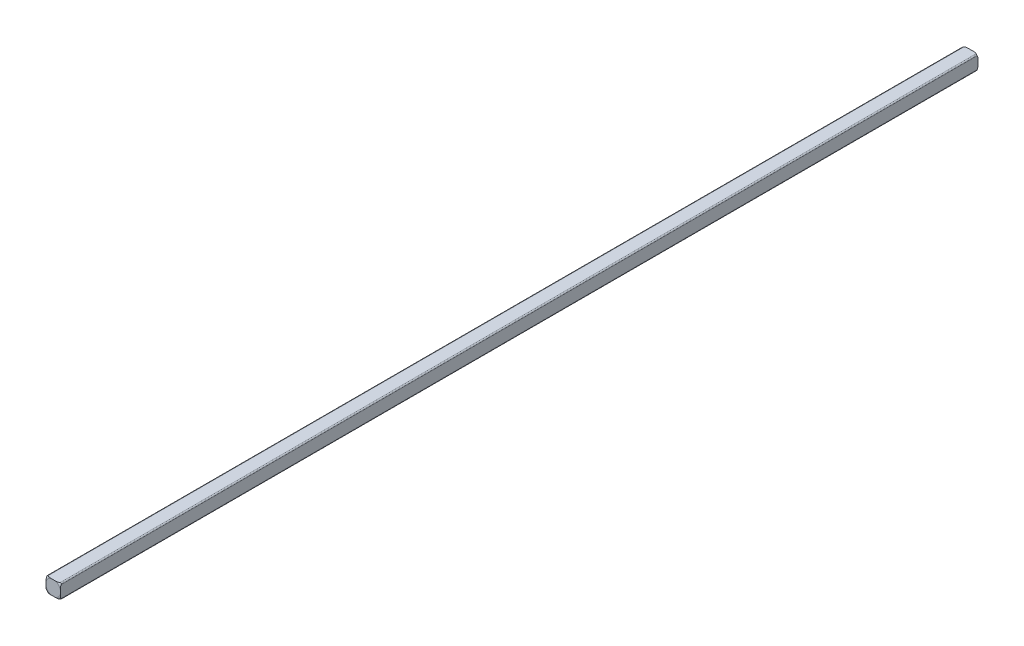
ISO-10303-21;
HEADER;
FILE_DESCRIPTION(('STEP AP214'),'2;1');
FILE_NAME('part.step','',(''),(''),'','','');
FILE_SCHEMA(('AUTOMOTIVE_DESIGN { 1 0 10303 214 1 1 1 1 }'));
ENDSEC;
DATA;
#1=APPLICATION_CONTEXT('core data for automotive mechanical design processes');
#2=APPLICATION_PROTOCOL_DEFINITION('international standard','automotive_design',2000,#1);
#3=PRODUCT_CONTEXT('',#1,'mechanical');
#4=PRODUCT('Part','Part','',(#3));
#5=PRODUCT_RELATED_PRODUCT_CATEGORY('part','',(#4));
#6=PRODUCT_DEFINITION_FORMATION('','',#4);
#7=PRODUCT_DEFINITION_CONTEXT('part definition',#1,'design');
#8=PRODUCT_DEFINITION('design','',#6,#7);
#9=PRODUCT_DEFINITION_SHAPE('','',#8);
#10=(LENGTH_UNIT() NAMED_UNIT(*) SI_UNIT(.MILLI.,.METRE.));
#11=(NAMED_UNIT(*) PLANE_ANGLE_UNIT() SI_UNIT($,.RADIAN.));
#12=(NAMED_UNIT(*) SI_UNIT($,.STERADIAN.) SOLID_ANGLE_UNIT());
#13=UNCERTAINTY_MEASURE_WITH_UNIT(LENGTH_MEASURE(1.E-05),#10,'distance_accuracy_value','');
#14=(GEOMETRIC_REPRESENTATION_CONTEXT(3) GLOBAL_UNCERTAINTY_ASSIGNED_CONTEXT((#13)) GLOBAL_UNIT_ASSIGNED_CONTEXT((#10,
#11,#12)) REPRESENTATION_CONTEXT('',''));
#15=CARTESIAN_POINT('',(0.,0.,0.));
#16=DIRECTION('',(0.,0.,1.));
#17=DIRECTION('',(1.,0.,0.));
#18=AXIS2_PLACEMENT_3D('',#15,#16,#17);
#19=CARTESIAN_POINT('',(0.,0.,151.765));
#20=DIRECTION('',(0.,0.,-1.));
#21=DIRECTION('',(1.,0.,0.));
#22=AXIS2_PLACEMENT_3D('',#19,#20,#21);
#23=TOROIDAL_SURFACE('',#22,1.63185378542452,0.634999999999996);
#24=CARTESIAN_POINT('',(-0.377876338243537,1.5875,152.4));
#25=CARTESIAN_POINT('',(-0.426955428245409,1.58750000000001,152.399972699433));
#26=CARTESIAN_POINT('',(-0.476057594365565,1.5875,152.399695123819));
#27=CARTESIAN_POINT('',(-0.574418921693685,1.5875,152.397747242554));
#28=CARTESIAN_POINT('',(-0.623677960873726,1.58749999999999,152.396071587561));
#29=CARTESIAN_POINT('',(-0.723913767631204,1.58750000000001,152.39031688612));
#30=CARTESIAN_POINT('',(-0.774886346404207,1.58750000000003,152.386150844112));
#31=CARTESIAN_POINT('',(-0.876340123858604,1.58749999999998,152.37416322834));
#32=CARTESIAN_POINT('',(-0.926821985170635,1.58749999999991,152.366347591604));
#33=CARTESIAN_POINT('',(-1.03968865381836,1.58750000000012,152.343126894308));
#34=CARTESIAN_POINT('',(-1.10179917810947,1.58750000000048,152.326287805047));
#35=CARTESIAN_POINT('',(-1.22173099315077,1.58749999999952,152.282177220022));
#36=CARTESIAN_POINT('',(-1.27959244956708,1.58749999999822,152.255024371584));
#37=CARTESIAN_POINT('',(-1.36359413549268,1.58749999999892,152.202783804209));
#38=CARTESIAN_POINT('',(-1.39245604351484,1.58749999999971,152.182082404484));
#39=CARTESIAN_POINT('',(-1.44669209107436,1.58750000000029,152.136431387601));
#40=CARTESIAN_POINT('',(-1.4720655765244,1.58750000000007,152.1114809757));
#41=CARTESIAN_POINT('',(-1.51404623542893,1.58749999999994,152.062038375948));
#42=CARTESIAN_POINT('',(-1.53141043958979,1.58749999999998,152.038192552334));
#43=CARTESIAN_POINT('',(-1.56193958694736,1.58750000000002,151.987988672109));
#44=CARTESIAN_POINT('',(-1.57511315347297,1.5875,151.961635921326));
#45=CARTESIAN_POINT('',(-1.59654474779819,1.5875,151.906864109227));
#46=CARTESIAN_POINT('',(-1.60478749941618,1.5875,151.878438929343));
#47=CARTESIAN_POINT('',(-1.61299775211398,1.5875,151.834926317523));
#48=CARTESIAN_POINT('',(-1.61504186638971,1.5875,151.820207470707));
#49=CARTESIAN_POINT('',(-1.61768666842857,1.5875,151.790631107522));
#50=CARTESIAN_POINT('',(-1.61828640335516,1.5875,151.775773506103));
#51=CARTESIAN_POINT('',(-1.61815024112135,1.5875,151.76091293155));
#52=B_SPLINE_CURVE_WITH_KNOTS('',3,(#24,#25,#26,#27,#28,#29,#30,#31,#32,#33,#34,#35,#36,#37,#38,
#39,#40,#41,#42,#43,#44,#45,#46,#47,#48,#49,#50,#51),.UNSPECIFIED.,.F.,.F.,(4,2,2,2,2,2,2,2,2,2,
2,2,2,4),(0.,0.147273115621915,0.295112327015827,0.448445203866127,0.601529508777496,
0.793946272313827,0.984213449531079,1.09043096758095,1.19666837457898,1.2848031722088,
1.37275541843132,1.46097875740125,1.50549646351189,1.55004352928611),.UNSPECIFIED.);
#53=CARTESIAN_POINT('',(-0.377876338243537,1.5875,152.4));
#54=VERTEX_POINT('',#53);
#55=CARTESIAN_POINT('',(-1.33349999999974,1.58749999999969,152.221499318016));
#56=VERTEX_POINT('',#55);
#57=EDGE_CURVE('E371',#54,#56,#52,.T.);
#58=ORIENTED_EDGE('',*,*,#57,.T.);
#59=CARTESIAN_POINT('',(-1.33349999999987,1.58749999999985,152.221499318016));
#60=CARTESIAN_POINT('',(-1.3469079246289,1.58748566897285,152.213190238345));
#61=CARTESIAN_POINT('',(-1.36046268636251,1.58643563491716,152.20497320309));
#62=CARTESIAN_POINT('',(-1.38783838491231,1.58201648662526,152.189246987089));
#63=CARTESIAN_POINT('',(-1.40166046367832,1.57861670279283,152.181748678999));
#64=CARTESIAN_POINT('',(-1.42521880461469,1.570587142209,152.170181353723));
#65=CARTESIAN_POINT('',(-1.43498690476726,1.56659229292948,152.165746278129));
#66=CARTESIAN_POINT('',(-1.45425932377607,1.55721249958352,152.158001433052));
#67=CARTESIAN_POINT('',(-1.46376466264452,1.55183414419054,152.154686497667));
#68=CARTESIAN_POINT('',(-1.48078992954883,1.5406427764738,152.14994940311));
#69=CARTESIAN_POINT('',(-1.48838416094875,1.53503704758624,152.148309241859));
#70=CARTESIAN_POINT('',(-1.50299443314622,1.52291375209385,152.146252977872));
#71=CARTESIAN_POINT('',(-1.51001060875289,1.51639639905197,152.145836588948));
#72=CARTESIAN_POINT('',(-1.52324184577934,1.50263078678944,152.146280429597));
#73=CARTESIAN_POINT('',(-1.5294566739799,1.49538231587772,152.14714102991));
#74=CARTESIAN_POINT('',(-1.54093535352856,1.48038761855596,152.150033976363));
#75=CARTESIAN_POINT('',(-1.54619862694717,1.47264109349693,152.152067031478));
#76=CARTESIAN_POINT('',(-1.55717012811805,1.45446300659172,152.157864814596));
#77=CARTESIAN_POINT('',(-1.5625287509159,1.44392996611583,152.161967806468));
#78=CARTESIAN_POINT('',(-1.57162418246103,1.4226499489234,152.171336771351));
#79=CARTESIAN_POINT('',(-1.57535394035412,1.4119022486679,152.176607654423));
#80=CARTESIAN_POINT('',(-1.58147222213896,1.38976321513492,152.188219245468));
#81=CARTESIAN_POINT('',(-1.58376977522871,1.37837092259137,152.194604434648));
#82=CARTESIAN_POINT('',(-1.58677095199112,1.35579141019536,152.207801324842));
#83=CARTESIAN_POINT('',(-1.58749208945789,1.34460332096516,152.214607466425));
#84=CARTESIAN_POINT('',(-1.5875,1.3335,152.221499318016));
#85=B_SPLINE_CURVE_WITH_KNOTS('',3,(#59,#60,#61,#62,#63,#64,#65,#66,#67,#68,#69,#70,#71,#72,#73,
#74,#75,#76,#77,#78,#79,#80,#81,#82,#83,#84),.UNSPECIFIED.,.F.,.F.,(4,2,2,2,2,2,2,2,2,2,2,2,4),
(0.,0.0474135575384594,0.0954579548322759,0.129685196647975,0.163752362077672,0.192367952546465,
0.220976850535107,0.249594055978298,0.278228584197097,0.315551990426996,0.353035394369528,
0.392706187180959,0.431933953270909),.UNSPECIFIED.);
#86=CARTESIAN_POINT('',(-1.5875,1.3335,152.221499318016));
#87=VERTEX_POINT('',#86);
#88=EDGE_CURVE('E13',#56,#87,#85,.T.);
#89=ORIENTED_EDGE('',*,*,#88,.T.);
#90=CARTESIAN_POINT('',(-1.5875,1.61815024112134,151.76091293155));
#91=CARTESIAN_POINT('',(-1.5875,1.61827741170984,151.774832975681));
#92=CARTESIAN_POINT('',(-1.5875,1.61775944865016,151.788750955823));
#93=CARTESIAN_POINT('',(-1.5875,1.61545341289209,151.816474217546));
#94=CARTESIAN_POINT('',(-1.5875,1.61366599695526,151.83027955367));
#95=CARTESIAN_POINT('',(-1.5875,1.60646537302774,151.871178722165));
#96=CARTESIAN_POINT('',(-1.5875,1.59921496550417,151.897968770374));
#97=CARTESIAN_POINT('',(-1.5875,1.58026897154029,151.949840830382));
#98=CARTESIAN_POINT('',(-1.5875,1.56858090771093,151.974925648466));
#99=CARTESIAN_POINT('',(-1.5875,1.54138158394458,152.022961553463));
#100=CARTESIAN_POINT('',(-1.5875,1.52586349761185,152.045908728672));
#101=CARTESIAN_POINT('',(-1.5875,1.48463218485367,152.098302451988));
#102=CARTESIAN_POINT('',(-1.5875,1.45735516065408,152.126519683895));
#103=CARTESIAN_POINT('',(-1.5875,1.39838558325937,152.177801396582));
#104=CARTESIAN_POINT('',(-1.5875,1.36668795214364,152.20085987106));
#105=CARTESIAN_POINT('',(-1.5875,1.28789122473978,152.249863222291));
#106=CARTESIAN_POINT('',(-1.5875,1.23946785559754,152.273658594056));
#107=CARTESIAN_POINT('',(-1.5875,1.13931384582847,152.313649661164));
#108=CARTESIAN_POINT('',(-1.5875,1.08756118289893,152.329787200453));
#109=CARTESIAN_POINT('',(-1.5875,0.98070328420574,152.356377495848));
#110=CARTESIAN_POINT('',(-1.5875,0.925544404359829,152.366605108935));
#111=CARTESIAN_POINT('',(-1.5875,0.81445134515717,152.382238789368));
#112=CARTESIAN_POINT('',(-1.5875,0.75851548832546,152.387631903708));
#113=CARTESIAN_POINT('',(-1.5875,0.648312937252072,152.3950507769));
#114=CARTESIAN_POINT('',(-1.5875,0.594052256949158,152.397182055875));
#115=CARTESIAN_POINT('',(-1.5875,0.485806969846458,152.399631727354));
#116=CARTESIAN_POINT('',(-1.5875,0.431822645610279,152.399960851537));
#117=CARTESIAN_POINT('',(-1.5875,0.377876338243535,152.4));
#118=B_SPLINE_CURVE_WITH_KNOTS('',3,(#90,#91,#92,#93,#94,#95,#96,#97,#98,#99,#100,#101,#102,
#103,#104,#105,#106,#107,#108,#109,#110,#111,#112,#113,#114,#115,#116,#117),.UNSPECIFIED.,.F.,
.F.,(4,2,2,2,2,2,2,2,2,2,2,2,2,4),(0.,0.0417318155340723,0.0834420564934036,0.166232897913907,
0.248884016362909,0.331683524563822,0.448675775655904,0.565803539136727,0.726767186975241,
0.888934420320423,1.05692964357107,1.22537364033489,1.38824385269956,1.55014312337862),.UNSPECIFIED.);
#119=CARTESIAN_POINT('',(-1.5875,0.377876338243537,152.4));
#120=VERTEX_POINT('',#119);
#121=EDGE_CURVE('E374',#87,#120,#118,.T.);
#122=ORIENTED_EDGE('',*,*,#121,.T.);
#123=CARTESIAN_POINT('',(0.,0.,152.4));
#124=DIRECTION('',(0.,0.,-1.));
#125=DIRECTION('',(-0.97282000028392,0.231562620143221,0.));
#126=AXIS2_PLACEMENT_3D('',#123,#124,#125);
#127=CIRCLE('',#126,1.63185378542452);
#128=EDGE_CURVE('E525',#120,#54,#127,.T.);
#129=ORIENTED_EDGE('',*,*,#128,.T.);
#130=EDGE_LOOP('',(#58,#89,#122,#129));
#131=FACE_BOUND('',#130,.T.);
#132=ADVANCED_FACE('F46',(#131),#23,.T.);
#133=CARTESIAN_POINT('',(0.,0.,151.765));
#134=DIRECTION('',(0.,0.,-1.));
#135=DIRECTION('',(1.,0.,0.));
#136=AXIS2_PLACEMENT_3D('',#133,#134,#135);
#137=TOROIDAL_SURFACE('',#136,1.63185378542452,0.634999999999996);
#138=CARTESIAN_POINT('',(0.377876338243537,-1.5875,152.4));
#139=CARTESIAN_POINT('',(0.426955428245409,-1.58750000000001,152.399972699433));
#140=CARTESIAN_POINT('',(0.476057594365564,-1.5875,152.399695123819));
#141=CARTESIAN_POINT('',(0.574418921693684,-1.5875,152.397747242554));
#142=CARTESIAN_POINT('',(0.623677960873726,-1.58749999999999,152.396071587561));
#143=CARTESIAN_POINT('',(0.723913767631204,-1.58750000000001,152.39031688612));
#144=CARTESIAN_POINT('',(0.774886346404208,-1.58750000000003,152.386150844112));
#145=CARTESIAN_POINT('',(0.876340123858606,-1.58749999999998,152.37416322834));
#146=CARTESIAN_POINT('',(0.926821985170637,-1.58749999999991,152.366347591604));
#147=CARTESIAN_POINT('',(1.03968865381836,-1.58750000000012,152.343126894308));
#148=CARTESIAN_POINT('',(1.10179917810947,-1.58750000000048,152.326287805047));
#149=CARTESIAN_POINT('',(1.22173099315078,-1.58749999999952,152.282177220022));
#150=CARTESIAN_POINT('',(1.27959244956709,-1.58749999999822,152.255024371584));
#151=CARTESIAN_POINT('',(1.36359413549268,-1.58749999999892,152.202783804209));
#152=CARTESIAN_POINT('',(1.39245604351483,-1.58749999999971,152.182082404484));
#153=CARTESIAN_POINT('',(1.44669209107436,-1.58750000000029,152.136431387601));
#154=CARTESIAN_POINT('',(1.4720655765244,-1.58750000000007,152.1114809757));
#155=CARTESIAN_POINT('',(1.51404623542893,-1.58749999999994,152.062038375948));
#156=CARTESIAN_POINT('',(1.53141043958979,-1.58749999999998,152.038192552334));
#157=CARTESIAN_POINT('',(1.56193958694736,-1.58750000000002,151.987988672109));
#158=CARTESIAN_POINT('',(1.57511315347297,-1.5875,151.961635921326));
#159=CARTESIAN_POINT('',(1.59654474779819,-1.5875,151.906864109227));
#160=CARTESIAN_POINT('',(1.60478749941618,-1.5875,151.878438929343));
#161=CARTESIAN_POINT('',(1.61299775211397,-1.5875,151.834926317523));
#162=CARTESIAN_POINT('',(1.61504186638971,-1.5875,151.820207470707));
#163=CARTESIAN_POINT('',(1.61768666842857,-1.5875,151.790631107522));
#164=CARTESIAN_POINT('',(1.61828640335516,-1.5875,151.775773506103));
#165=CARTESIAN_POINT('',(1.61815024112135,-1.5875,151.76091293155));
#166=B_SPLINE_CURVE_WITH_KNOTS('',3,(#138,#139,#140,#141,#142,#143,#144,#145,#146,#147,#148,
#149,#150,#151,#152,#153,#154,#155,#156,#157,#158,#159,#160,#161,#162,#163,#164,#165),
.UNSPECIFIED.,.F.,.F.,(4,2,2,2,2,2,2,2,2,2,2,2,2,4),(0.,0.147273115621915,0.295112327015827,
0.448445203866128,0.601529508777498,0.793946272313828,0.98421344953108,1.09043096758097,
1.19666837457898,1.28480317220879,1.37275541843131,1.46097875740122,1.50549646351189,
1.55004352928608),.UNSPECIFIED.);
#167=CARTESIAN_POINT('',(0.377876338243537,-1.5875,152.4));
#168=VERTEX_POINT('',#167);
#169=CARTESIAN_POINT('',(1.33349999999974,-1.58749999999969,152.221499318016));
#170=VERTEX_POINT('',#169);
#171=EDGE_CURVE('E500',#168,#170,#166,.T.);
#172=ORIENTED_EDGE('',*,*,#171,.T.);
#173=CARTESIAN_POINT('',(1.33349999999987,-1.58749999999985,152.221499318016));
#174=CARTESIAN_POINT('',(1.3469079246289,-1.58748566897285,152.213190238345));
#175=CARTESIAN_POINT('',(1.36046268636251,-1.58643563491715,152.20497320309));
#176=CARTESIAN_POINT('',(1.38783838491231,-1.58201648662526,152.189246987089));
#177=CARTESIAN_POINT('',(1.40166046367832,-1.57861670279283,152.181748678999));
#178=CARTESIAN_POINT('',(1.42521880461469,-1.570587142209,152.170181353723));
#179=CARTESIAN_POINT('',(1.43498690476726,-1.56659229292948,152.165746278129));
#180=CARTESIAN_POINT('',(1.45425932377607,-1.55721249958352,152.158001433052));
#181=CARTESIAN_POINT('',(1.46376466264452,-1.55183414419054,152.154686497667));
#182=CARTESIAN_POINT('',(1.48078992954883,-1.5406427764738,152.14994940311));
#183=CARTESIAN_POINT('',(1.48838416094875,-1.53503704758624,152.148309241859));
#184=CARTESIAN_POINT('',(1.50299443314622,-1.52291375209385,152.146252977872));
#185=CARTESIAN_POINT('',(1.51001060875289,-1.51639639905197,152.145836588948));
#186=CARTESIAN_POINT('',(1.52324184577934,-1.50263078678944,152.146280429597));
#187=CARTESIAN_POINT('',(1.5294566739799,-1.49538231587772,152.14714102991));
#188=CARTESIAN_POINT('',(1.54093535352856,-1.48038761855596,152.150033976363));
#189=CARTESIAN_POINT('',(1.54619862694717,-1.47264109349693,152.152067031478));
#190=CARTESIAN_POINT('',(1.55717012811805,-1.45446300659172,152.157864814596));
#191=CARTESIAN_POINT('',(1.5625287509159,-1.44392996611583,152.161967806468));
#192=CARTESIAN_POINT('',(1.57162418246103,-1.4226499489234,152.171336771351));
#193=CARTESIAN_POINT('',(1.57535394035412,-1.4119022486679,152.176607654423));
#194=CARTESIAN_POINT('',(1.58147222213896,-1.38976321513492,152.188219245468));
#195=CARTESIAN_POINT('',(1.58376977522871,-1.37837092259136,152.194604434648));
#196=CARTESIAN_POINT('',(1.58677095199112,-1.35579141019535,152.207801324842));
#197=CARTESIAN_POINT('',(1.58749208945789,-1.34460332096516,152.214607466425));
#198=CARTESIAN_POINT('',(1.5875,-1.3335,152.221499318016));
#199=B_SPLINE_CURVE_WITH_KNOTS('',3,(#173,#174,#175,#176,#177,#178,#179,#180,#181,#182,#183,
#184,#185,#186,#187,#188,#189,#190,#191,#192,#193,#194,#195,#196,#197,#198),.UNSPECIFIED.,.F.,
.F.,(4,2,2,2,2,2,2,2,2,2,2,2,4),(0.,0.0474135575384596,0.0954579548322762,0.129685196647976,
0.163752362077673,0.192367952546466,0.220976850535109,0.2495940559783,0.278228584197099,
0.315551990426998,0.35303539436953,0.39270618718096,0.43193395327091),.UNSPECIFIED.);
#200=CARTESIAN_POINT('',(1.5875,-1.3335,152.221499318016));
#201=VERTEX_POINT('',#200);
#202=EDGE_CURVE('E754',#170,#201,#199,.T.);
#203=ORIENTED_EDGE('',*,*,#202,.T.);
#204=CARTESIAN_POINT('',(1.5875,-1.61815024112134,151.76091293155));
#205=CARTESIAN_POINT('',(1.5875,-1.61827741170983,151.774832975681));
#206=CARTESIAN_POINT('',(1.5875,-1.61775944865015,151.788750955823));
#207=CARTESIAN_POINT('',(1.5875,-1.61545341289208,151.816474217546));
#208=CARTESIAN_POINT('',(1.5875,-1.61366599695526,151.83027955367));
#209=CARTESIAN_POINT('',(1.5875,-1.60646537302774,151.871178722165));
#210=CARTESIAN_POINT('',(1.5875,-1.59921496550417,151.897968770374));
#211=CARTESIAN_POINT('',(1.5875,-1.58026897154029,151.949840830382));
#212=CARTESIAN_POINT('',(1.5875,-1.56858090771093,151.974925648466));
#213=CARTESIAN_POINT('',(1.5875,-1.54138158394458,152.022961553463));
#214=CARTESIAN_POINT('',(1.5875,-1.52586349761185,152.045908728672));
#215=CARTESIAN_POINT('',(1.5875,-1.48463218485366,152.098302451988));
#216=CARTESIAN_POINT('',(1.5875,-1.45735516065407,152.126519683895));
#217=CARTESIAN_POINT('',(1.5875,-1.39838558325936,152.177801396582));
#218=CARTESIAN_POINT('',(1.5875,-1.36668795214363,152.20085987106));
#219=CARTESIAN_POINT('',(1.5875,-1.28789122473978,152.249863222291));
#220=CARTESIAN_POINT('',(1.5875,-1.23946785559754,152.273658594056));
#221=CARTESIAN_POINT('',(1.5875,-1.13931384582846,152.313649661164));
#222=CARTESIAN_POINT('',(1.5875,-1.08756118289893,152.329787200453));
#223=CARTESIAN_POINT('',(1.5875,-0.980703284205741,152.356377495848));
#224=CARTESIAN_POINT('',(1.5875,-0.925544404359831,152.366605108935));
#225=CARTESIAN_POINT('',(1.5875,-0.814451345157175,152.382238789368));
#226=CARTESIAN_POINT('',(1.5875,-0.758515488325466,152.387631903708));
#227=CARTESIAN_POINT('',(1.5875,-0.648312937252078,152.3950507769));
#228=CARTESIAN_POINT('',(1.5875,-0.594052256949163,152.397182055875));
#229=CARTESIAN_POINT('',(1.5875,-0.48580696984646,152.399631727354));
#230=CARTESIAN_POINT('',(1.5875,-0.43182264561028,152.399960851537));
#231=CARTESIAN_POINT('',(1.5875,-0.377876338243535,152.4));
#232=B_SPLINE_CURVE_WITH_KNOTS('',3,(#204,#205,#206,#207,#208,#209,#210,#211,#212,#213,#214,
#215,#216,#217,#218,#219,#220,#221,#222,#223,#224,#225,#226,#227,#228,#229,#230,#231),
.UNSPECIFIED.,.F.,.F.,(4,2,2,2,2,2,2,2,2,2,2,2,2,4),(0.,0.0417318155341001,0.0834420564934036,
0.166232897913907,0.248884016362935,0.331683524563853,0.448675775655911,0.56580353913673,
0.726767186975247,0.888934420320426,1.05692964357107,1.22537364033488,1.38824385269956,
1.55014312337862),.UNSPECIFIED.);
#233=CARTESIAN_POINT('',(1.5875,-0.377876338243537,152.4));
#234=VERTEX_POINT('',#233);
#235=EDGE_CURVE('E716',#201,#234,#232,.T.);
#236=ORIENTED_EDGE('',*,*,#235,.T.);
#237=CARTESIAN_POINT('',(0.,0.,152.4));
#238=DIRECTION('',(0.,0.,-1.));
#239=DIRECTION('',(0.97282000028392,-0.231562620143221,0.));
#240=AXIS2_PLACEMENT_3D('',#237,#238,#239);
#241=CIRCLE('',#240,1.63185378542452);
#242=EDGE_CURVE('E518',#234,#168,#241,.T.);
#243=ORIENTED_EDGE('',*,*,#242,.T.);
#244=EDGE_LOOP('',(#172,#203,#236,#243));
#245=FACE_BOUND('',#244,.T.);
#246=ADVANCED_FACE('F474',(#245),#137,.T.);
#247=CARTESIAN_POINT('',(0.,0.,151.765));
#248=DIRECTION('',(0.,0.,-1.));
#249=DIRECTION('',(1.,0.,0.));
#250=AXIS2_PLACEMENT_3D('',#247,#248,#249);
#251=TOROIDAL_SURFACE('',#250,1.63185378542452,0.634999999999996);
#252=CARTESIAN_POINT('',(-1.5875,-0.377876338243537,152.4));
#253=CARTESIAN_POINT('',(-1.58750000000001,-0.426955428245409,152.399972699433));
#254=CARTESIAN_POINT('',(-1.5875,-0.476057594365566,152.399695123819));
#255=CARTESIAN_POINT('',(-1.5875,-0.574418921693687,152.397747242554));
#256=CARTESIAN_POINT('',(-1.58749999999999,-0.623677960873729,152.396071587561));
#257=CARTESIAN_POINT('',(-1.58750000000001,-0.723913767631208,152.39031688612));
#258=CARTESIAN_POINT('',(-1.58750000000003,-0.774886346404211,152.386150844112));
#259=CARTESIAN_POINT('',(-1.58749999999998,-0.876340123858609,152.37416322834));
#260=CARTESIAN_POINT('',(-1.58749999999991,-0.92682198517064,152.366347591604));
#261=CARTESIAN_POINT('',(-1.58750000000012,-1.03968865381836,152.343126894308));
#262=CARTESIAN_POINT('',(-1.58750000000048,-1.10179917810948,152.326287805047));
#263=CARTESIAN_POINT('',(-1.58749999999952,-1.22173099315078,152.282177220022));
#264=CARTESIAN_POINT('',(-1.58749999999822,-1.27959244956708,152.255024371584));
#265=CARTESIAN_POINT('',(-1.58749999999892,-1.36359413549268,152.202783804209));
#266=CARTESIAN_POINT('',(-1.58749999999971,-1.39245604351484,152.182082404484));
#267=CARTESIAN_POINT('',(-1.58750000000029,-1.44669209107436,152.136431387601));
#268=CARTESIAN_POINT('',(-1.58750000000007,-1.4720655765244,152.1114809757));
#269=CARTESIAN_POINT('',(-1.58749999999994,-1.51404623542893,152.062038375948));
#270=CARTESIAN_POINT('',(-1.58749999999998,-1.53141043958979,152.038192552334));
#271=CARTESIAN_POINT('',(-1.58750000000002,-1.56193958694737,151.987988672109));
#272=CARTESIAN_POINT('',(-1.5875,-1.57511315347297,151.961635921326));
#273=CARTESIAN_POINT('',(-1.5875,-1.5965447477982,151.906864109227));
#274=CARTESIAN_POINT('',(-1.5875,-1.60478749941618,151.878438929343));
#275=CARTESIAN_POINT('',(-1.5875,-1.61299775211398,151.834926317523));
#276=CARTESIAN_POINT('',(-1.5875,-1.61504186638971,151.820207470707));
#277=CARTESIAN_POINT('',(-1.5875,-1.61768666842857,151.790631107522));
#278=CARTESIAN_POINT('',(-1.5875,-1.61828640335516,151.775773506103));
#279=CARTESIAN_POINT('',(-1.5875,-1.61815024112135,151.76091293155));
#280=B_SPLINE_CURVE_WITH_KNOTS('',3,(#252,#253,#254,#255,#256,#257,#258,#259,#260,#261,#262,
#263,#264,#265,#266,#267,#268,#269,#270,#271,#272,#273,#274,#275,#276,#277,#278,#279),
.UNSPECIFIED.,.F.,.F.,(4,2,2,2,2,2,2,2,2,2,2,2,2,4),(0.,0.147273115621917,0.295112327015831,
0.448445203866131,0.601529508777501,0.793946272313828,0.984213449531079,1.09043096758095,
1.19666837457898,1.2848031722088,1.37275541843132,1.46097875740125,1.50549646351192,
1.55004352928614),.UNSPECIFIED.);
#281=CARTESIAN_POINT('',(-1.5875,-0.377876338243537,152.4));
#282=VERTEX_POINT('',#281);
#283=CARTESIAN_POINT('',(-1.58749999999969,-1.33349999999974,152.221499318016));
#284=VERTEX_POINT('',#283);
#285=EDGE_CURVE('E566',#282,#284,#280,.T.);
#286=ORIENTED_EDGE('',*,*,#285,.T.);
#287=CARTESIAN_POINT('',(-1.58749999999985,-1.33349999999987,152.221499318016));
#288=CARTESIAN_POINT('',(-1.58748566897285,-1.3469079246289,152.213190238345));
#289=CARTESIAN_POINT('',(-1.58643563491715,-1.36046268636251,152.20497320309));
#290=CARTESIAN_POINT('',(-1.58201648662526,-1.38783838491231,152.189246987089));
#291=CARTESIAN_POINT('',(-1.57861670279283,-1.40166046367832,152.181748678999));
#292=CARTESIAN_POINT('',(-1.570587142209,-1.42521880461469,152.170181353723));
#293=CARTESIAN_POINT('',(-1.56659229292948,-1.43498690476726,152.165746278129));
#294=CARTESIAN_POINT('',(-1.55721249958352,-1.45425932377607,152.158001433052));
#295=CARTESIAN_POINT('',(-1.55183414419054,-1.46376466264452,152.154686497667));
#296=CARTESIAN_POINT('',(-1.5406427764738,-1.48078992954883,152.14994940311));
#297=CARTESIAN_POINT('',(-1.53503704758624,-1.48838416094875,152.148309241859));
#298=CARTESIAN_POINT('',(-1.52291375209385,-1.50299443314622,152.146252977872));
#299=CARTESIAN_POINT('',(-1.51639639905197,-1.51001060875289,152.145836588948));
#300=CARTESIAN_POINT('',(-1.50263078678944,-1.52324184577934,152.146280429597));
#301=CARTESIAN_POINT('',(-1.49538231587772,-1.5294566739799,152.14714102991));
#302=CARTESIAN_POINT('',(-1.48038761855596,-1.54093535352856,152.150033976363));
#303=CARTESIAN_POINT('',(-1.47264109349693,-1.54619862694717,152.152067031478));
#304=CARTESIAN_POINT('',(-1.45446300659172,-1.55717012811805,152.157864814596));
#305=CARTESIAN_POINT('',(-1.44392996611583,-1.5625287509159,152.161967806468));
#306=CARTESIAN_POINT('',(-1.4226499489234,-1.57162418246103,152.171336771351));
#307=CARTESIAN_POINT('',(-1.4119022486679,-1.57535394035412,152.176607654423));
#308=CARTESIAN_POINT('',(-1.38976321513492,-1.58147222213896,152.188219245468));
#309=CARTESIAN_POINT('',(-1.37837092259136,-1.58376977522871,152.194604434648));
#310=CARTESIAN_POINT('',(-1.35579141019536,-1.58677095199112,152.207801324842));
#311=CARTESIAN_POINT('',(-1.34460332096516,-1.58749208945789,152.214607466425));
#312=CARTESIAN_POINT('',(-1.3335,-1.5875,152.221499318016));
#313=B_SPLINE_CURVE_WITH_KNOTS('',3,(#287,#288,#289,#290,#291,#292,#293,#294,#295,#296,#297,
#298,#299,#300,#301,#302,#303,#304,#305,#306,#307,#308,#309,#310,#311,#312),.UNSPECIFIED.,.F.,
.F.,(4,2,2,2,2,2,2,2,2,2,2,2,4),(0.,0.0474135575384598,0.095457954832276,0.129685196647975,
0.163752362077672,0.192367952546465,0.220976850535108,0.249594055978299,0.278228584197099,
0.315551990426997,0.353035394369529,0.39270618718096,0.431933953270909),.UNSPECIFIED.);
#314=CARTESIAN_POINT('',(-1.3335,-1.5875,152.221499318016));
#315=VERTEX_POINT('',#314);
#316=EDGE_CURVE('E737',#284,#315,#313,.T.);
#317=ORIENTED_EDGE('',*,*,#316,.T.);
#318=CARTESIAN_POINT('',(-1.61815024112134,-1.5875,151.76091293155));
#319=CARTESIAN_POINT('',(-1.61827741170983,-1.5875,151.774832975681));
#320=CARTESIAN_POINT('',(-1.61775944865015,-1.5875,151.788750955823));
#321=CARTESIAN_POINT('',(-1.61545341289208,-1.5875,151.816474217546));
#322=CARTESIAN_POINT('',(-1.61366599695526,-1.5875,151.83027955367));
#323=CARTESIAN_POINT('',(-1.60646537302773,-1.5875,151.871178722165));
#324=CARTESIAN_POINT('',(-1.59921496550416,-1.5875,151.897968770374));
#325=CARTESIAN_POINT('',(-1.58026897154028,-1.5875,151.949840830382));
#326=CARTESIAN_POINT('',(-1.56858090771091,-1.5875,151.974925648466));
#327=CARTESIAN_POINT('',(-1.54138158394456,-1.5875,152.022961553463));
#328=CARTESIAN_POINT('',(-1.52586349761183,-1.5875,152.045908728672));
#329=CARTESIAN_POINT('',(-1.48463218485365,-1.5875,152.098302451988));
#330=CARTESIAN_POINT('',(-1.45735516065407,-1.5875,152.126519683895));
#331=CARTESIAN_POINT('',(-1.39838558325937,-1.5875,152.177801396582));
#332=CARTESIAN_POINT('',(-1.36668795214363,-1.5875,152.20085987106));
#333=CARTESIAN_POINT('',(-1.28789122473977,-1.5875,152.249863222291));
#334=CARTESIAN_POINT('',(-1.23946785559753,-1.5875,152.273658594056));
#335=CARTESIAN_POINT('',(-1.13931384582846,-1.5875,152.313649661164));
#336=CARTESIAN_POINT('',(-1.08756118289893,-1.5875,152.329787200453));
#337=CARTESIAN_POINT('',(-0.980703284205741,-1.5875,152.356377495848));
#338=CARTESIAN_POINT('',(-0.925544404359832,-1.5875,152.366605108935));
#339=CARTESIAN_POINT('',(-0.814451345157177,-1.5875,152.382238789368));
#340=CARTESIAN_POINT('',(-0.758515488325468,-1.5875,152.387631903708));
#341=CARTESIAN_POINT('',(-0.648312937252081,-1.5875,152.3950507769));
#342=CARTESIAN_POINT('',(-0.594052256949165,-1.5875,152.397182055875));
#343=CARTESIAN_POINT('',(-0.485806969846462,-1.5875,152.399631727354));
#344=CARTESIAN_POINT('',(-0.431822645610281,-1.5875,152.399960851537));
#345=CARTESIAN_POINT('',(-0.377876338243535,-1.5875,152.4));
#346=B_SPLINE_CURVE_WITH_KNOTS('',3,(#318,#319,#320,#321,#322,#323,#324,#325,#326,#327,#328,
#329,#330,#331,#332,#333,#334,#335,#336,#337,#338,#339,#340,#341,#342,#343,#344,#345),
.UNSPECIFIED.,.F.,.F.,(4,2,2,2,2,2,2,2,2,2,2,2,2,4),(0.,0.0417318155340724,0.083442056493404,
0.166232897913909,0.24888401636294,0.331683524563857,0.448675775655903,0.565803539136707,
0.726767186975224,0.888934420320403,1.05692964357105,1.22537364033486,1.38824385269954,
1.5501431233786),.UNSPECIFIED.);
#347=CARTESIAN_POINT('',(-0.377876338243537,-1.5875,152.4));
#348=VERTEX_POINT('',#347);
#349=EDGE_CURVE('E704',#315,#348,#346,.T.);
#350=ORIENTED_EDGE('',*,*,#349,.T.);
#351=CARTESIAN_POINT('',(0.,0.,152.4));
#352=DIRECTION('',(0.,0.,-1.));
#353=DIRECTION('',(-0.231562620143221,-0.97282000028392,0.));
#354=AXIS2_PLACEMENT_3D('',#351,#352,#353);
#355=CIRCLE('',#354,1.63185378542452);
#356=EDGE_CURVE('E648',#348,#282,#355,.T.);
#357=ORIENTED_EDGE('',*,*,#356,.T.);
#358=EDGE_LOOP('',(#286,#317,#350,#357));
#359=FACE_BOUND('',#358,.T.);
#360=ADVANCED_FACE('F477',(#359),#251,.T.);
#361=CARTESIAN_POINT('',(-1.5875,1.5875,152.4));
#362=DIRECTION('',(0.,0.,-1.));
#363=DIRECTION('',(-1.,0.,0.));
#364=AXIS2_PLACEMENT_3D('',#361,#362,#363);
#365=PLANE('',#364);
#366=ORIENTED_EDGE('',*,*,#356,.F.);
#367=DIRECTION('',(-1.,0.,0.));
#368=VECTOR('',#367,1.);
#369=CARTESIAN_POINT('',(-1.5875,-1.5875,152.4));
#370=LINE('',#369,#368);
#371=EDGE_CURVE('E511',#168,#348,#370,.T.);
#372=ORIENTED_EDGE('',*,*,#371,.F.);
#373=ORIENTED_EDGE('',*,*,#242,.F.);
#374=DIRECTION('',(0.,1.,0.));
#375=VECTOR('',#374,1.);
#376=CARTESIAN_POINT('',(1.5875,1.5875,152.4));
#377=LINE('',#376,#375);
#378=CARTESIAN_POINT('',(1.5875,0.377876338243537,152.4));
#379=VERTEX_POINT('',#378);
#380=EDGE_CURVE('E513',#379,#234,#377,.F.);
#381=ORIENTED_EDGE('',*,*,#380,.F.);
#382=CARTESIAN_POINT('',(0.,0.,152.4));
#383=DIRECTION('',(0.,0.,-1.));
#384=DIRECTION('',(0.231562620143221,0.97282000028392,0.));
#385=AXIS2_PLACEMENT_3D('',#382,#383,#384);
#386=CIRCLE('',#385,1.63185378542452);
#387=CARTESIAN_POINT('',(0.377876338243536,1.5875,152.4));
#388=VERTEX_POINT('',#387);
#389=EDGE_CURVE('E531',#388,#379,#386,.T.);
#390=ORIENTED_EDGE('',*,*,#389,.F.);
#391=DIRECTION('',(-1.,0.,0.));
#392=VECTOR('',#391,1.);
#393=CARTESIAN_POINT('',(-1.5875,1.5875,152.4));
#394=LINE('',#393,#392);
#395=EDGE_CURVE('E519',#54,#388,#394,.F.);
#396=ORIENTED_EDGE('',*,*,#395,.F.);
#397=ORIENTED_EDGE('',*,*,#128,.F.);
#398=DIRECTION('',(0.,1.,0.));
#399=VECTOR('',#398,1.);
#400=CARTESIAN_POINT('',(-1.5875,1.5875,152.4));
#401=LINE('',#400,#399);
#402=EDGE_CURVE('E643',#282,#120,#401,.T.);
#403=ORIENTED_EDGE('',*,*,#402,.F.);
#404=EDGE_LOOP('',(#366,#372,#373,#381,#390,#396,#397,#403));
#405=FACE_BOUND('',#404,.T.);
#406=ADVANCED_FACE('F546',(#405),#365,.F.);
#407=CARTESIAN_POINT('',(0.,0.,151.765));
#408=DIRECTION('',(0.,0.,-1.));
#409=DIRECTION('',(1.,0.,0.));
#410=AXIS2_PLACEMENT_3D('',#407,#408,#409);
#411=TOROIDAL_SURFACE('',#410,1.63185378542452,0.634999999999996);
#412=CARTESIAN_POINT('',(1.5875,0.377876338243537,152.4));
#413=CARTESIAN_POINT('',(1.58750000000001,0.426955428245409,152.399972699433));
#414=CARTESIAN_POINT('',(1.5875,0.476057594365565,152.399695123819));
#415=CARTESIAN_POINT('',(1.5875,0.574418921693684,152.397747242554));
#416=CARTESIAN_POINT('',(1.58749999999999,0.623677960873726,152.396071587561));
#417=CARTESIAN_POINT('',(1.58750000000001,0.723913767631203,152.39031688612));
#418=CARTESIAN_POINT('',(1.58750000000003,0.774886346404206,152.386150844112));
#419=CARTESIAN_POINT('',(1.58749999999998,0.876340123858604,152.37416322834));
#420=CARTESIAN_POINT('',(1.58749999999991,0.926821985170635,152.366347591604));
#421=CARTESIAN_POINT('',(1.58750000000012,1.03968865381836,152.343126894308));
#422=CARTESIAN_POINT('',(1.58750000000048,1.10179917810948,152.326287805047));
#423=CARTESIAN_POINT('',(1.58749999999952,1.22173099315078,152.282177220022));
#424=CARTESIAN_POINT('',(1.58749999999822,1.27959244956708,152.255024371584));
#425=CARTESIAN_POINT('',(1.58749999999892,1.36359413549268,152.202783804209));
#426=CARTESIAN_POINT('',(1.58749999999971,1.39245604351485,152.182082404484));
#427=CARTESIAN_POINT('',(1.58750000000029,1.44669209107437,152.136431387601));
#428=CARTESIAN_POINT('',(1.58750000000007,1.4720655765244,152.1114809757));
#429=CARTESIAN_POINT('',(1.58749999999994,1.51404623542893,152.062038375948));
#430=CARTESIAN_POINT('',(1.58749999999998,1.53141043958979,152.038192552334));
#431=CARTESIAN_POINT('',(1.58750000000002,1.56193958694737,151.987988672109));
#432=CARTESIAN_POINT('',(1.5875,1.57511315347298,151.961635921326));
#433=CARTESIAN_POINT('',(1.5875,1.59654474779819,151.906864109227));
#434=CARTESIAN_POINT('',(1.5875,1.60478749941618,151.878438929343));
#435=CARTESIAN_POINT('',(1.5875,1.61299775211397,151.834926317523));
#436=CARTESIAN_POINT('',(1.5875,1.61504186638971,151.820207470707));
#437=CARTESIAN_POINT('',(1.5875,1.61768666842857,151.790631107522));
#438=CARTESIAN_POINT('',(1.5875,1.61828640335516,151.775773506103));
#439=CARTESIAN_POINT('',(1.5875,1.61815024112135,151.76091293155));
#440=B_SPLINE_CURVE_WITH_KNOTS('',3,(#412,#413,#414,#415,#416,#417,#418,#419,#420,#421,#422,
#423,#424,#425,#426,#427,#428,#429,#430,#431,#432,#433,#434,#435,#436,#437,#438,#439),
.UNSPECIFIED.,.F.,.F.,(4,2,2,2,2,2,2,2,2,2,2,2,2,4),(0.,0.147273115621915,0.295112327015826,
0.448445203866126,0.601529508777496,0.793946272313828,0.984213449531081,1.09043096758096,
1.19666837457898,1.2848031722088,1.37275541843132,1.46097875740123,1.50549646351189,
1.55004352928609),.UNSPECIFIED.);
#441=CARTESIAN_POINT('',(1.58749999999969,1.33349999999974,152.221499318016));
#442=VERTEX_POINT('',#441);
#443=EDGE_CURVE('E565',#379,#442,#440,.T.);
#444=ORIENTED_EDGE('',*,*,#443,.T.);
#445=CARTESIAN_POINT('',(1.58749999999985,1.33349999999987,152.221499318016));
#446=CARTESIAN_POINT('',(1.58748566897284,1.3469079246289,152.213190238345));
#447=CARTESIAN_POINT('',(1.58643563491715,1.36046268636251,152.20497320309));
#448=CARTESIAN_POINT('',(1.58201648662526,1.38783838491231,152.189246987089));
#449=CARTESIAN_POINT('',(1.57861670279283,1.40166046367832,152.181748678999));
#450=CARTESIAN_POINT('',(1.570587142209,1.42521880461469,152.170181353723));
#451=CARTESIAN_POINT('',(1.56659229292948,1.43498690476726,152.165746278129));
#452=CARTESIAN_POINT('',(1.55721249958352,1.45425932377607,152.158001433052));
#453=CARTESIAN_POINT('',(1.55183414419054,1.46376466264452,152.154686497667));
#454=CARTESIAN_POINT('',(1.5406427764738,1.48078992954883,152.14994940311));
#455=CARTESIAN_POINT('',(1.53503704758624,1.48838416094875,152.148309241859));
#456=CARTESIAN_POINT('',(1.52291375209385,1.50299443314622,152.146252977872));
#457=CARTESIAN_POINT('',(1.51639639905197,1.51001060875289,152.145836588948));
#458=CARTESIAN_POINT('',(1.50263078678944,1.52324184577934,152.146280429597));
#459=CARTESIAN_POINT('',(1.49538231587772,1.5294566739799,152.14714102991));
#460=CARTESIAN_POINT('',(1.48038761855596,1.54093535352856,152.150033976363));
#461=CARTESIAN_POINT('',(1.47264109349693,1.54619862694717,152.152067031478));
#462=CARTESIAN_POINT('',(1.45446300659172,1.55717012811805,152.157864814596));
#463=CARTESIAN_POINT('',(1.44392996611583,1.5625287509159,152.161967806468));
#464=CARTESIAN_POINT('',(1.4226499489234,1.57162418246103,152.171336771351));
#465=CARTESIAN_POINT('',(1.4119022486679,1.57535394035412,152.176607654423));
#466=CARTESIAN_POINT('',(1.38976321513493,1.58147222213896,152.188219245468));
#467=CARTESIAN_POINT('',(1.37837092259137,1.58376977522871,152.194604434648));
#468=CARTESIAN_POINT('',(1.35579141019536,1.58677095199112,152.207801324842));
#469=CARTESIAN_POINT('',(1.34460332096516,1.58749208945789,152.214607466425));
#470=CARTESIAN_POINT('',(1.3335,1.5875,152.221499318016));
#471=B_SPLINE_CURVE_WITH_KNOTS('',3,(#445,#446,#447,#448,#449,#450,#451,#452,#453,#454,#455,
#456,#457,#458,#459,#460,#461,#462,#463,#464,#465,#466,#467,#468,#469,#470),.UNSPECIFIED.,.F.,
.F.,(4,2,2,2,2,2,2,2,2,2,2,2,4),(0.,0.0474135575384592,0.0954579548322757,0.129685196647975,
0.163752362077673,0.192367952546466,0.220976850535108,0.249594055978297,0.278228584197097,
0.315551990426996,0.353035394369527,0.392706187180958,0.431933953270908),.UNSPECIFIED.);
#472=CARTESIAN_POINT('',(1.3335,1.5875,152.221499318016));
#473=VERTEX_POINT('',#472);
#474=EDGE_CURVE('E59',#442,#473,#471,.T.);
#475=ORIENTED_EDGE('',*,*,#474,.T.);
#476=CARTESIAN_POINT('',(1.61815024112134,1.5875,151.76091293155));
#477=CARTESIAN_POINT('',(1.61827741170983,1.5875,151.774832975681));
#478=CARTESIAN_POINT('',(1.61775944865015,1.5875,151.788750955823));
#479=CARTESIAN_POINT('',(1.61545341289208,1.5875,151.816474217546));
#480=CARTESIAN_POINT('',(1.61366599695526,1.5875,151.83027955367));
#481=CARTESIAN_POINT('',(1.60646537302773,1.5875,151.871178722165));
#482=CARTESIAN_POINT('',(1.59921496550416,1.5875,151.897968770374));
#483=CARTESIAN_POINT('',(1.58026897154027,1.5875,151.949840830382));
#484=CARTESIAN_POINT('',(1.56858090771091,1.5875,151.974925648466));
#485=CARTESIAN_POINT('',(1.54138158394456,1.5875,152.022961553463));
#486=CARTESIAN_POINT('',(1.52586349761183,1.5875,152.045908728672));
#487=CARTESIAN_POINT('',(1.48463218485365,1.5875,152.098302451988));
#488=CARTESIAN_POINT('',(1.45735516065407,1.5875,152.126519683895));
#489=CARTESIAN_POINT('',(1.39838558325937,1.5875,152.177801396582));
#490=CARTESIAN_POINT('',(1.36668795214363,1.5875,152.20085987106));
#491=CARTESIAN_POINT('',(1.28789122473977,1.5875,152.249863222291));
#492=CARTESIAN_POINT('',(1.23946785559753,1.5875,152.273658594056));
#493=CARTESIAN_POINT('',(1.13931384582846,1.5875,152.313649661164));
#494=CARTESIAN_POINT('',(1.08756118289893,1.5875,152.329787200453));
#495=CARTESIAN_POINT('',(0.980703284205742,1.5875,152.356377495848));
#496=CARTESIAN_POINT('',(0.925544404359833,1.5875,152.366605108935));
#497=CARTESIAN_POINT('',(0.814451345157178,1.5875,152.382238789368));
#498=CARTESIAN_POINT('',(0.75851548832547,1.5875,152.387631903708));
#499=CARTESIAN_POINT('',(0.648312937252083,1.5875,152.3950507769));
#500=CARTESIAN_POINT('',(0.594052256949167,1.5875,152.397182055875));
#501=CARTESIAN_POINT('',(0.485806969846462,1.5875,152.399631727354));
#502=CARTESIAN_POINT('',(0.431822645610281,1.5875,152.399960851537));
#503=CARTESIAN_POINT('',(0.377876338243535,1.5875,152.4));
#504=B_SPLINE_CURVE_WITH_KNOTS('',3,(#476,#477,#478,#479,#480,#481,#482,#483,#484,#485,#486,
#487,#488,#489,#490,#491,#492,#493,#494,#495,#496,#497,#498,#499,#500,#501,#502,#503),
.UNSPECIFIED.,.F.,.F.,(4,2,2,2,2,2,2,2,2,2,2,2,2,4),(0.,0.0417318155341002,0.083442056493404,
0.166232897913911,0.248884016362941,0.331683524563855,0.448675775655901,0.565803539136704,
0.726767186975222,0.8889344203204,1.05692964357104,1.22537364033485,1.38824385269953,
1.55014312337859),.UNSPECIFIED.);
#505=EDGE_CURVE('E726',#473,#388,#504,.T.);
#506=ORIENTED_EDGE('',*,*,#505,.T.);
#507=ORIENTED_EDGE('',*,*,#389,.T.);
#508=EDGE_LOOP('',(#444,#475,#506,#507));
#509=FACE_BOUND('',#508,.T.);
#510=ADVANCED_FACE('F537',(#509),#411,.T.);
#511=CARTESIAN_POINT('',(-1.5875,1.5875,152.4));
#512=DIRECTION('',(0.,-1.,0.));
#513=DIRECTION('',(0.,0.,-1.));
#514=AXIS2_PLACEMENT_3D('',#511,#512,#513);
#515=PLANE('',#514);
#516=DIRECTION('',(0.,0.,-1.));
#517=VECTOR('',#516,1.);
#518=CARTESIAN_POINT('',(1.3335,1.5875,152.4));
#519=LINE('',#518,#517);
#520=CARTESIAN_POINT('',(1.3335,1.5875,-50.6214993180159));
#521=VERTEX_POINT('',#520);
#522=EDGE_CURVE('E764',#473,#521,#519,.T.);
#523=ORIENTED_EDGE('',*,*,#522,.T.);
#524=CARTESIAN_POINT('',(1.61815024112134,1.5875,-50.1609129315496));
#525=CARTESIAN_POINT('',(1.61827741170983,1.5875,-50.174832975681));
#526=CARTESIAN_POINT('',(1.61775944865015,1.5875,-50.188750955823));
#527=CARTESIAN_POINT('',(1.61545341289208,1.5875,-50.2164742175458));
#528=CARTESIAN_POINT('',(1.61366599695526,1.5875,-50.2302795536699));
#529=CARTESIAN_POINT('',(1.60646537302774,1.5875,-50.2711787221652));
#530=CARTESIAN_POINT('',(1.59921496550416,1.5875,-50.2979687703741));
#531=CARTESIAN_POINT('',(1.58026897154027,1.5875,-50.3498408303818));
#532=CARTESIAN_POINT('',(1.56858090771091,1.5875,-50.3749256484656));
#533=CARTESIAN_POINT('',(1.54138158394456,1.5875,-50.4229615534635));
#534=CARTESIAN_POINT('',(1.52586349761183,1.5875,-50.4459087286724));
#535=CARTESIAN_POINT('',(1.48463218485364,1.5875,-50.4983024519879));
#536=CARTESIAN_POINT('',(1.45735516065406,1.5875,-50.5265196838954));
#537=CARTESIAN_POINT('',(1.39838558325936,1.5875,-50.5778013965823));
#538=CARTESIAN_POINT('',(1.36668795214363,1.5875,-50.6008598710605));
#539=CARTESIAN_POINT('',(1.28789122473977,1.5875,-50.6498632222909));
#540=CARTESIAN_POINT('',(1.23946785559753,1.5875,-50.6736585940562));
#541=CARTESIAN_POINT('',(1.13931384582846,1.5875,-50.7136496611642));
#542=CARTESIAN_POINT('',(1.08756118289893,1.5875,-50.7297872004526));
#543=CARTESIAN_POINT('',(0.98070328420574,1.5875,-50.7563774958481));
#544=CARTESIAN_POINT('',(0.92554440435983,1.5875,-50.7666051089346));
#545=CARTESIAN_POINT('',(0.814451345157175,1.5875,-50.7822387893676));
#546=CARTESIAN_POINT('',(0.758515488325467,1.5875,-50.7876319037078));
#547=CARTESIAN_POINT('',(0.648312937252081,1.5875,-50.7950507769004));
#548=CARTESIAN_POINT('',(0.594052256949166,1.5875,-50.7971820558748));
#549=CARTESIAN_POINT('',(0.485806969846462,1.5875,-50.7996317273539));
#550=CARTESIAN_POINT('',(0.431822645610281,1.5875,-50.7999608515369));
#551=CARTESIAN_POINT('',(0.377876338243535,1.5875,-50.8));
#552=B_SPLINE_CURVE_WITH_KNOTS('',3,(#524,#525,#526,#527,#528,#529,#530,#531,#532,#533,#534,
#535,#536,#537,#538,#539,#540,#541,#542,#543,#544,#545,#546,#547,#548,#549,#550,#551),
.UNSPECIFIED.,.F.,.F.,(4,2,2,2,2,2,2,2,2,2,2,2,2,4),(0.,0.0417318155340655,0.08344205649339,
0.166232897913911,0.248884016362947,0.331683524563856,0.448675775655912,0.565803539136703,
0.726767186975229,0.888934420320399,1.05692964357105,1.22537364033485,1.38824385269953,
1.55014312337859),.UNSPECIFIED.);
#553=CARTESIAN_POINT('',(0.377876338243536,1.5875,-50.8));
#554=VERTEX_POINT('',#553);
#555=EDGE_CURVE('E195',#521,#554,#552,.T.);
#556=ORIENTED_EDGE('',*,*,#555,.T.);
#557=DIRECTION('',(-1.,0.,0.));
#558=VECTOR('',#557,1.);
#559=CARTESIAN_POINT('',(-1.5875,1.5875,-50.8));
#560=LINE('',#559,#558);
#561=CARTESIAN_POINT('',(-0.377876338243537,1.5875,-50.8));
#562=VERTEX_POINT('',#561);
#563=EDGE_CURVE('E188',#562,#554,#560,.F.);
#564=ORIENTED_EDGE('',*,*,#563,.F.);
#565=CARTESIAN_POINT('',(-0.377876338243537,1.5875,-50.8));
#566=CARTESIAN_POINT('',(-0.426955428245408,1.58750000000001,-50.7999726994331));
#567=CARTESIAN_POINT('',(-0.476057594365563,1.5875,-50.7996951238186));
#568=CARTESIAN_POINT('',(-0.574418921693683,1.5875,-50.7977472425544));
#569=CARTESIAN_POINT('',(-0.623677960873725,1.58749999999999,-50.7960715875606));
#570=CARTESIAN_POINT('',(-0.723913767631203,1.58750000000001,-50.7903168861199));
#571=CARTESIAN_POINT('',(-0.774886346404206,1.58750000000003,-50.7861508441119));
#572=CARTESIAN_POINT('',(-0.876340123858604,1.58749999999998,-50.7741632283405));
#573=CARTESIAN_POINT('',(-0.926821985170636,1.58749999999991,-50.7663475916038));
#574=CARTESIAN_POINT('',(-1.03968865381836,1.58750000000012,-50.743126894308));
#575=CARTESIAN_POINT('',(-1.10179917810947,1.58750000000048,-50.7262878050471));
#576=CARTESIAN_POINT('',(-1.22173099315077,1.58749999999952,-50.6821772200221));
#577=CARTESIAN_POINT('',(-1.27959244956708,1.58749999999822,-50.6550243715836));
#578=CARTESIAN_POINT('',(-1.36359413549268,1.58749999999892,-50.602783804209));
#579=CARTESIAN_POINT('',(-1.39245604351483,1.58749999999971,-50.5820824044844));
#580=CARTESIAN_POINT('',(-1.44669209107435,1.58750000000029,-50.5364313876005));
#581=CARTESIAN_POINT('',(-1.47206557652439,1.58750000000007,-50.5114809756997));
#582=CARTESIAN_POINT('',(-1.51404623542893,1.58749999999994,-50.4620383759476));
#583=CARTESIAN_POINT('',(-1.5314104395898,1.58749999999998,-50.4381925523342));
#584=CARTESIAN_POINT('',(-1.56193958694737,1.58750000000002,-50.3879886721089));
#585=CARTESIAN_POINT('',(-1.57511315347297,1.5875,-50.3616359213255));
#586=CARTESIAN_POINT('',(-1.59654474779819,1.5875,-50.3068641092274));
#587=CARTESIAN_POINT('',(-1.60478749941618,1.5875,-50.2784389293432));
#588=CARTESIAN_POINT('',(-1.61299775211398,1.5875,-50.234926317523));
#589=CARTESIAN_POINT('',(-1.61504186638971,1.5875,-50.2202074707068));
#590=CARTESIAN_POINT('',(-1.61768666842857,1.5875,-50.1906311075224));
#591=CARTESIAN_POINT('',(-1.61828640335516,1.5875,-50.1757735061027));
#592=CARTESIAN_POINT('',(-1.61815024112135,1.5875,-50.1609129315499));
#593=B_SPLINE_CURVE_WITH_KNOTS('',3,(#565,#566,#567,#568,#569,#570,#571,#572,#573,#574,#575,
#576,#577,#578,#579,#580,#581,#582,#583,#584,#585,#586,#587,#588,#589,#590,#591,#592),
.UNSPECIFIED.,.F.,.F.,(4,2,2,2,2,2,2,2,2,2,2,2,2,4),(0.,0.147273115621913,0.295112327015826,
0.448445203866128,0.601529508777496,0.79394627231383,0.984213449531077,1.09043096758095,
1.19666837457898,1.28480317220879,1.37275541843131,1.46097875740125,1.50549646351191,
1.55004352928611),.UNSPECIFIED.);
#594=CARTESIAN_POINT('',(-1.33349999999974,1.58749999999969,-50.6214993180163));
#595=VERTEX_POINT('',#594);
#596=EDGE_CURVE('E345',#562,#595,#593,.T.);
#597=ORIENTED_EDGE('',*,*,#596,.T.);
#598=DIRECTION('',(0.,0.,-1.));
#599=VECTOR('',#598,1.);
#600=CARTESIAN_POINT('',(-1.3335,1.5875,152.4));
#601=LINE('',#600,#599);
#602=EDGE_CURVE('E66',#595,#56,#601,.F.);
#603=ORIENTED_EDGE('',*,*,#602,.T.);
#604=ORIENTED_EDGE('',*,*,#57,.F.);
#605=ORIENTED_EDGE('',*,*,#395,.T.);
#606=ORIENTED_EDGE('',*,*,#505,.F.);
#607=EDGE_LOOP('',(#523,#556,#564,#597,#603,#604,#605,#606));
#608=FACE_BOUND('',#607,.T.);
#609=ADVANCED_FACE('F361',(#608),#515,.F.);
#610=CARTESIAN_POINT('',(1.5875,-1.5875,152.4));
#611=DIRECTION('',(-1.,0.,0.));
#612=DIRECTION('',(0.,0.,1.));
#613=AXIS2_PLACEMENT_3D('',#610,#611,#612);
#614=PLANE('',#613);
#615=DIRECTION('',(0.,0.,-1.));
#616=VECTOR('',#615,1.);
#617=CARTESIAN_POINT('',(1.5875,-1.3335,152.4));
#618=LINE('',#617,#616);
#619=CARTESIAN_POINT('',(1.5875,-1.3335,-50.6214993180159));
#620=VERTEX_POINT('',#619);
#621=EDGE_CURVE('E760',#201,#620,#618,.T.);
#622=ORIENTED_EDGE('',*,*,#621,.T.);
#623=CARTESIAN_POINT('',(1.5875,-1.61815024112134,-50.1609129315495));
#624=CARTESIAN_POINT('',(1.5875,-1.61827741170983,-50.1748329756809));
#625=CARTESIAN_POINT('',(1.5875,-1.61775944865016,-50.188750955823));
#626=CARTESIAN_POINT('',(1.5875,-1.61545341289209,-50.2164742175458));
#627=CARTESIAN_POINT('',(1.5875,-1.61366599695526,-50.2302795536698));
#628=CARTESIAN_POINT('',(1.5875,-1.60646537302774,-50.2711787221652));
#629=CARTESIAN_POINT('',(1.5875,-1.59921496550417,-50.2979687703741));
#630=CARTESIAN_POINT('',(1.5875,-1.58026897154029,-50.3498408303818));
#631=CARTESIAN_POINT('',(1.5875,-1.56858090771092,-50.3749256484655));
#632=CARTESIAN_POINT('',(1.5875,-1.54138158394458,-50.4229615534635));
#633=CARTESIAN_POINT('',(1.5875,-1.52586349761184,-50.4459087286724));
#634=CARTESIAN_POINT('',(1.5875,-1.48463218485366,-50.4983024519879));
#635=CARTESIAN_POINT('',(1.5875,-1.45735516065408,-50.5265196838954));
#636=CARTESIAN_POINT('',(1.5875,-1.39838558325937,-50.5778013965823));
#637=CARTESIAN_POINT('',(1.5875,-1.36668795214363,-50.6008598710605));
#638=CARTESIAN_POINT('',(1.5875,-1.28789122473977,-50.6498632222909));
#639=CARTESIAN_POINT('',(1.5875,-1.23946785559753,-50.6736585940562));
#640=CARTESIAN_POINT('',(1.5875,-1.13931384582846,-50.7136496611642));
#641=CARTESIAN_POINT('',(1.5875,-1.08756118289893,-50.7297872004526));
#642=CARTESIAN_POINT('',(1.5875,-0.980703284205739,-50.7563774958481));
#643=CARTESIAN_POINT('',(1.5875,-0.925544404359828,-50.7666051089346));
#644=CARTESIAN_POINT('',(1.5875,-0.814451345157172,-50.7822387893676));
#645=CARTESIAN_POINT('',(1.5875,-0.758515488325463,-50.7876319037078));
#646=CARTESIAN_POINT('',(1.5875,-0.648312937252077,-50.7950507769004));
#647=CARTESIAN_POINT('',(1.5875,-0.594052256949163,-50.7971820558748));
#648=CARTESIAN_POINT('',(1.5875,-0.485806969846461,-50.7996317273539));
#649=CARTESIAN_POINT('',(1.5875,-0.431822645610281,-50.7999608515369));
#650=CARTESIAN_POINT('',(1.5875,-0.377876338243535,-50.8));
#651=B_SPLINE_CURVE_WITH_KNOTS('',3,(#623,#624,#625,#626,#627,#628,#629,#630,#631,#632,#633,
#634,#635,#636,#637,#638,#639,#640,#641,#642,#643,#644,#645,#646,#647,#648,#649,#650),
.UNSPECIFIED.,.F.,.F.,(4,2,2,2,2,2,2,2,2,2,2,2,2,4),(0.,0.0417318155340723,0.0834420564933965,
0.166232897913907,0.248884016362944,0.331683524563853,0.448675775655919,0.565803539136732,
0.726767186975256,0.888934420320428,1.05692964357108,1.22537364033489,1.38824385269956,
1.55014312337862),.UNSPECIFIED.);
#652=CARTESIAN_POINT('',(1.5875,-0.377876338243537,-50.8));
#653=VERTEX_POINT('',#652);
#654=EDGE_CURVE('E182',#620,#653,#651,.T.);
#655=ORIENTED_EDGE('',*,*,#654,.T.);
#656=DIRECTION('',(0.,1.,0.));
#657=VECTOR('',#656,1.);
#658=CARTESIAN_POINT('',(1.5875,1.5875,-50.8));
#659=LINE('',#658,#657);
#660=CARTESIAN_POINT('',(1.5875,0.377876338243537,-50.8));
#661=VERTEX_POINT('',#660);
#662=EDGE_CURVE('E179',#661,#653,#659,.F.);
#663=ORIENTED_EDGE('',*,*,#662,.F.);
#664=CARTESIAN_POINT('',(1.5875,0.377876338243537,-50.8));
#665=CARTESIAN_POINT('',(1.58750000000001,0.426955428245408,-50.7999726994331));
#666=CARTESIAN_POINT('',(1.5875,0.476057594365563,-50.7996951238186));
#667=CARTESIAN_POINT('',(1.5875,0.574418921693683,-50.7977472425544));
#668=CARTESIAN_POINT('',(1.58749999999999,0.623677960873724,-50.7960715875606));
#669=CARTESIAN_POINT('',(1.58750000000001,0.723913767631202,-50.7903168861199));
#670=CARTESIAN_POINT('',(1.58750000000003,0.774886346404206,-50.7861508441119));
#671=CARTESIAN_POINT('',(1.58749999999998,0.876340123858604,-50.7741632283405));
#672=CARTESIAN_POINT('',(1.58749999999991,0.926821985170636,-50.7663475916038));
#673=CARTESIAN_POINT('',(1.58750000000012,1.03968865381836,-50.743126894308));
#674=CARTESIAN_POINT('',(1.58750000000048,1.10179917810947,-50.7262878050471));
#675=CARTESIAN_POINT('',(1.58749999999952,1.22173099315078,-50.6821772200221));
#676=CARTESIAN_POINT('',(1.58749999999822,1.27959244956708,-50.6550243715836));
#677=CARTESIAN_POINT('',(1.58749999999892,1.36359413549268,-50.602783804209));
#678=CARTESIAN_POINT('',(1.58749999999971,1.39245604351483,-50.5820824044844));
#679=CARTESIAN_POINT('',(1.58750000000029,1.44669209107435,-50.5364313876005));
#680=CARTESIAN_POINT('',(1.58750000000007,1.47206557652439,-50.5114809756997));
#681=CARTESIAN_POINT('',(1.58749999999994,1.51404623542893,-50.4620383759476));
#682=CARTESIAN_POINT('',(1.58749999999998,1.5314104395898,-50.4381925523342));
#683=CARTESIAN_POINT('',(1.58750000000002,1.56193958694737,-50.3879886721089));
#684=CARTESIAN_POINT('',(1.5875,1.57511315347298,-50.3616359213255));
#685=CARTESIAN_POINT('',(1.5875,1.59654474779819,-50.3068641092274));
#686=CARTESIAN_POINT('',(1.5875,1.60478749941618,-50.2784389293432));
#687=CARTESIAN_POINT('',(1.5875,1.61299775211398,-50.234926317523));
#688=CARTESIAN_POINT('',(1.5875,1.61504186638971,-50.2202074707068));
#689=CARTESIAN_POINT('',(1.5875,1.61768666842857,-50.1906311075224));
#690=CARTESIAN_POINT('',(1.5875,1.61828640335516,-50.1757735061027));
#691=CARTESIAN_POINT('',(1.5875,1.61815024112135,-50.1609129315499));
#692=B_SPLINE_CURVE_WITH_KNOTS('',3,(#664,#665,#666,#667,#668,#669,#670,#671,#672,#673,#674,
#675,#676,#677,#678,#679,#680,#681,#682,#683,#684,#685,#686,#687,#688,#689,#690,#691),
.UNSPECIFIED.,.F.,.F.,(4,2,2,2,2,2,2,2,2,2,2,2,2,4),(0.,0.147273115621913,0.295112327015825,
0.448445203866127,0.601529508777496,0.793946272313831,0.984213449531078,1.09043096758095,
1.19666837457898,1.28480317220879,1.37275541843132,1.46097875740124,1.5054964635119,
1.55004352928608),.UNSPECIFIED.);
#693=CARTESIAN_POINT('',(1.58749999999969,1.33349999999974,-50.6214993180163));
#694=VERTEX_POINT('',#693);
#695=EDGE_CURVE('E164',#661,#694,#692,.T.);
#696=ORIENTED_EDGE('',*,*,#695,.T.);
#697=DIRECTION('',(0.,0.,-1.));
#698=VECTOR('',#697,1.);
#699=CARTESIAN_POINT('',(1.5875,1.3335,152.4));
#700=LINE('',#699,#698);
#701=EDGE_CURVE('E742',#694,#442,#700,.F.);
#702=ORIENTED_EDGE('',*,*,#701,.T.);
#703=ORIENTED_EDGE('',*,*,#443,.F.);
#704=ORIENTED_EDGE('',*,*,#380,.T.);
#705=ORIENTED_EDGE('',*,*,#235,.F.);
#706=EDGE_LOOP('',(#622,#655,#663,#696,#702,#703,#704,#705));
#707=FACE_BOUND('',#706,.T.);
#708=ADVANCED_FACE('F180',(#707),#614,.F.);
#709=CARTESIAN_POINT('',(-1.5875,-1.5875,152.4));
#710=DIRECTION('',(1.,0.,0.));
#711=DIRECTION('',(0.,0.,-1.));
#712=AXIS2_PLACEMENT_3D('',#709,#710,#711);
#713=PLANE('',#712);
#714=DIRECTION('',(0.,0.,-1.));
#715=VECTOR('',#714,1.);
#716=CARTESIAN_POINT('',(-1.5875,1.3335,152.4));
#717=LINE('',#716,#715);
#718=CARTESIAN_POINT('',(-1.5875,1.3335,-50.6214993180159));
#719=VERTEX_POINT('',#718);
#720=EDGE_CURVE('E728',#87,#719,#717,.T.);
#721=ORIENTED_EDGE('',*,*,#720,.T.);
#722=CARTESIAN_POINT('',(-1.5875,1.61815024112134,-50.1609129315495));
#723=CARTESIAN_POINT('',(-1.5875,1.61827741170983,-50.1748329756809));
#724=CARTESIAN_POINT('',(-1.5875,1.61775944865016,-50.188750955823));
#725=CARTESIAN_POINT('',(-1.5875,1.61545341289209,-50.2164742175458));
#726=CARTESIAN_POINT('',(-1.5875,1.61366599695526,-50.2302795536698));
#727=CARTESIAN_POINT('',(-1.5875,1.60646537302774,-50.2711787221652));
#728=CARTESIAN_POINT('',(-1.5875,1.59921496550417,-50.2979687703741));
#729=CARTESIAN_POINT('',(-1.5875,1.58026897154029,-50.3498408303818));
#730=CARTESIAN_POINT('',(-1.5875,1.56858090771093,-50.3749256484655));
#731=CARTESIAN_POINT('',(-1.5875,1.54138158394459,-50.4229615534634));
#732=CARTESIAN_POINT('',(-1.5875,1.52586349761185,-50.4459087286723));
#733=CARTESIAN_POINT('',(-1.5875,1.48463218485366,-50.4983024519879));
#734=CARTESIAN_POINT('',(-1.5875,1.45735516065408,-50.5265196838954));
#735=CARTESIAN_POINT('',(-1.5875,1.39838558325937,-50.5778013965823));
#736=CARTESIAN_POINT('',(-1.5875,1.36668795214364,-50.6008598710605));
#737=CARTESIAN_POINT('',(-1.5875,1.28789122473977,-50.6498632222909));
#738=CARTESIAN_POINT('',(-1.5875,1.23946785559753,-50.6736585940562));
#739=CARTESIAN_POINT('',(-1.5875,1.13931384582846,-50.7136496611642));
#740=CARTESIAN_POINT('',(-1.5875,1.08756118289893,-50.7297872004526));
#741=CARTESIAN_POINT('',(-1.5875,0.980703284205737,-50.7563774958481));
#742=CARTESIAN_POINT('',(-1.5875,0.925544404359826,-50.7666051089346));
#743=CARTESIAN_POINT('',(-1.5875,0.814451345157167,-50.7822387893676));
#744=CARTESIAN_POINT('',(-1.5875,0.758515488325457,-50.7876319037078));
#745=CARTESIAN_POINT('',(-1.5875,0.648312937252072,-50.7950507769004));
#746=CARTESIAN_POINT('',(-1.5875,0.594052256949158,-50.7971820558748));
#747=CARTESIAN_POINT('',(-1.5875,0.485806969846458,-50.7996317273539));
#748=CARTESIAN_POINT('',(-1.5875,0.43182264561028,-50.7999608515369));
#749=CARTESIAN_POINT('',(-1.5875,0.377876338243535,-50.8));
#750=B_SPLINE_CURVE_WITH_KNOTS('',3,(#722,#723,#724,#725,#726,#727,#728,#729,#730,#731,#732,
#733,#734,#735,#736,#737,#738,#739,#740,#741,#742,#743,#744,#745,#746,#747,#748,#749),
.UNSPECIFIED.,.F.,.F.,(4,2,2,2,2,2,2,2,2,2,2,2,2,4),(0.,0.0417318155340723,0.0834420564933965,
0.166232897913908,0.248884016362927,0.331683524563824,0.448675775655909,0.56580353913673,
0.726767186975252,0.888934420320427,1.05692964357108,1.22537364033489,1.38824385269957,
1.55014312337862),.UNSPECIFIED.);
#751=CARTESIAN_POINT('',(-1.5875,0.377876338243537,-50.8));
#752=VERTEX_POINT('',#751);
#753=EDGE_CURVE('E341',#719,#752,#750,.T.);
#754=ORIENTED_EDGE('',*,*,#753,.T.);
#755=DIRECTION('',(0.,1.,0.));
#756=VECTOR('',#755,1.);
#757=CARTESIAN_POINT('',(-1.5875,1.5875,-50.8));
#758=LINE('',#757,#756);
#759=CARTESIAN_POINT('',(-1.5875,-0.377876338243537,-50.8));
#760=VERTEX_POINT('',#759);
#761=EDGE_CURVE('E176',#760,#752,#758,.T.);
#762=ORIENTED_EDGE('',*,*,#761,.F.);
#763=CARTESIAN_POINT('',(-1.5875,-0.377876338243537,-50.8));
#764=CARTESIAN_POINT('',(-1.58750000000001,-0.426955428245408,-50.7999726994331));
#765=CARTESIAN_POINT('',(-1.5875,-0.476057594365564,-50.7996951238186));
#766=CARTESIAN_POINT('',(-1.5875,-0.574418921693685,-50.7977472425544));
#767=CARTESIAN_POINT('',(-1.58749999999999,-0.623677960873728,-50.7960715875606));
#768=CARTESIAN_POINT('',(-1.58750000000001,-0.723913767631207,-50.7903168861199));
#769=CARTESIAN_POINT('',(-1.58750000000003,-0.774886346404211,-50.7861508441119));
#770=CARTESIAN_POINT('',(-1.58749999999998,-0.87634012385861,-50.7741632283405));
#771=CARTESIAN_POINT('',(-1.58749999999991,-0.926821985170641,-50.7663475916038));
#772=CARTESIAN_POINT('',(-1.58750000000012,-1.03968865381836,-50.743126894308));
#773=CARTESIAN_POINT('',(-1.58750000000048,-1.10179917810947,-50.7262878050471));
#774=CARTESIAN_POINT('',(-1.58749999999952,-1.22173099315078,-50.6821772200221));
#775=CARTESIAN_POINT('',(-1.58749999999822,-1.27959244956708,-50.6550243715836));
#776=CARTESIAN_POINT('',(-1.58749999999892,-1.36359413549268,-50.602783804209));
#777=CARTESIAN_POINT('',(-1.58749999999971,-1.39245604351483,-50.5820824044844));
#778=CARTESIAN_POINT('',(-1.58750000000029,-1.44669209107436,-50.5364313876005));
#779=CARTESIAN_POINT('',(-1.58750000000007,-1.47206557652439,-50.5114809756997));
#780=CARTESIAN_POINT('',(-1.58749999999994,-1.51404623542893,-50.4620383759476));
#781=CARTESIAN_POINT('',(-1.58749999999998,-1.53141043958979,-50.4381925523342));
#782=CARTESIAN_POINT('',(-1.58750000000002,-1.56193958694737,-50.3879886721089));
#783=CARTESIAN_POINT('',(-1.5875,-1.57511315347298,-50.3616359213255));
#784=CARTESIAN_POINT('',(-1.5875,-1.5965447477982,-50.3068641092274));
#785=CARTESIAN_POINT('',(-1.5875,-1.60478749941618,-50.2784389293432));
#786=CARTESIAN_POINT('',(-1.5875,-1.61299775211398,-50.234926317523));
#787=CARTESIAN_POINT('',(-1.5875,-1.61504186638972,-50.2202074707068));
#788=CARTESIAN_POINT('',(-1.5875,-1.61768666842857,-50.1906311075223));
#789=CARTESIAN_POINT('',(-1.5875,-1.61828640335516,-50.1757735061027));
#790=CARTESIAN_POINT('',(-1.5875,-1.61815024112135,-50.1609129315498));
#791=B_SPLINE_CURVE_WITH_KNOTS('',3,(#763,#764,#765,#766,#767,#768,#769,#770,#771,#772,#773,
#774,#775,#776,#777,#778,#779,#780,#781,#782,#783,#784,#785,#786,#787,#788,#789,#790),
.UNSPECIFIED.,.F.,.F.,(4,2,2,2,2,2,2,2,2,2,2,2,2,4),(0.,0.147273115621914,0.29511232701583,
0.448445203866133,0.601529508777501,0.793946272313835,0.984213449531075,1.09043096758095,
1.19666837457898,1.28480317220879,1.37275541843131,1.46097875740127,1.50549646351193,
1.55004352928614),.UNSPECIFIED.);
#792=CARTESIAN_POINT('',(-1.58749999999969,-1.33349999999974,-50.6214993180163));
#793=VERTEX_POINT('',#792);
#794=EDGE_CURVE('E335',#760,#793,#791,.T.);
#795=ORIENTED_EDGE('',*,*,#794,.T.);
#796=DIRECTION('',(0.,0.,-1.));
#797=VECTOR('',#796,1.);
#798=CARTESIAN_POINT('',(-1.5875,-1.3335,152.4));
#799=LINE('',#798,#797);
#800=EDGE_CURVE('E700',#793,#284,#799,.F.);
#801=ORIENTED_EDGE('',*,*,#800,.T.);
#802=ORIENTED_EDGE('',*,*,#285,.F.);
#803=ORIENTED_EDGE('',*,*,#402,.T.);
#804=ORIENTED_EDGE('',*,*,#121,.F.);
#805=EDGE_LOOP('',(#721,#754,#762,#795,#801,#802,#803,#804));
#806=FACE_BOUND('',#805,.T.);
#807=ADVANCED_FACE('F399',(#806),#713,.F.);
#808=CARTESIAN_POINT('',(-1.5875,-1.5875,152.4));
#809=DIRECTION('',(0.,1.,0.));
#810=DIRECTION('',(0.,0.,1.));
#811=AXIS2_PLACEMENT_3D('',#808,#809,#810);
#812=PLANE('',#811);
#813=DIRECTION('',(0.,0.,-1.));
#814=VECTOR('',#813,1.);
#815=CARTESIAN_POINT('',(-1.3335,-1.5875,152.4));
#816=LINE('',#815,#814);
#817=CARTESIAN_POINT('',(-1.3335,-1.5875,-50.6214993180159));
#818=VERTEX_POINT('',#817);
#819=EDGE_CURVE('E725',#315,#818,#816,.T.);
#820=ORIENTED_EDGE('',*,*,#819,.T.);
#821=CARTESIAN_POINT('',(-1.61815024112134,-1.5875,-50.1609129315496));
#822=CARTESIAN_POINT('',(-1.61827741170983,-1.5875,-50.174832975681));
#823=CARTESIAN_POINT('',(-1.61775944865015,-1.5875,-50.188750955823));
#824=CARTESIAN_POINT('',(-1.61545341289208,-1.5875,-50.2164742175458));
#825=CARTESIAN_POINT('',(-1.61366599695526,-1.5875,-50.2302795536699));
#826=CARTESIAN_POINT('',(-1.60646537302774,-1.5875,-50.2711787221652));
#827=CARTESIAN_POINT('',(-1.59921496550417,-1.5875,-50.2979687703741));
#828=CARTESIAN_POINT('',(-1.58026897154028,-1.5875,-50.3498408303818));
#829=CARTESIAN_POINT('',(-1.56858090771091,-1.5875,-50.3749256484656));
#830=CARTESIAN_POINT('',(-1.54138158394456,-1.5875,-50.4229615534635));
#831=CARTESIAN_POINT('',(-1.52586349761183,-1.5875,-50.4459087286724));
#832=CARTESIAN_POINT('',(-1.48463218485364,-1.5875,-50.4983024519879));
#833=CARTESIAN_POINT('',(-1.45735516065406,-1.5875,-50.5265196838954));
#834=CARTESIAN_POINT('',(-1.39838558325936,-1.5875,-50.5778013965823));
#835=CARTESIAN_POINT('',(-1.36668795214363,-1.5875,-50.6008598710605));
#836=CARTESIAN_POINT('',(-1.28789122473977,-1.5875,-50.6498632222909));
#837=CARTESIAN_POINT('',(-1.23946785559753,-1.5875,-50.6736585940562));
#838=CARTESIAN_POINT('',(-1.13931384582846,-1.5875,-50.7136496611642));
#839=CARTESIAN_POINT('',(-1.08756118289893,-1.5875,-50.7297872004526));
#840=CARTESIAN_POINT('',(-0.980703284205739,-1.5875,-50.7563774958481));
#841=CARTESIAN_POINT('',(-0.925544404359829,-1.5875,-50.7666051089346));
#842=CARTESIAN_POINT('',(-0.814451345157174,-1.5875,-50.7822387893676));
#843=CARTESIAN_POINT('',(-0.758515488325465,-1.5875,-50.7876319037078));
#844=CARTESIAN_POINT('',(-0.64831293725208,-1.5875,-50.7950507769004));
#845=CARTESIAN_POINT('',(-0.594052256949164,-1.5875,-50.7971820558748));
#846=CARTESIAN_POINT('',(-0.485806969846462,-1.5875,-50.7996317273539));
#847=CARTESIAN_POINT('',(-0.431822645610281,-1.5875,-50.7999608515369));
#848=CARTESIAN_POINT('',(-0.377876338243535,-1.5875,-50.8));
#849=B_SPLINE_CURVE_WITH_KNOTS('',3,(#821,#822,#823,#824,#825,#826,#827,#828,#829,#830,#831,
#832,#833,#834,#835,#836,#837,#838,#839,#840,#841,#842,#843,#844,#845,#846,#847,#848),
.UNSPECIFIED.,.F.,.F.,(4,2,2,2,2,2,2,2,2,2,2,2,2,4),(0.,0.0417318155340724,0.083442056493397,
0.166232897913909,0.248884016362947,0.331683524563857,0.448675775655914,0.565803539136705,
0.72676718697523,0.888934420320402,1.05692964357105,1.22537364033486,1.38824385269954,
1.55014312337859),.UNSPECIFIED.);
#850=CARTESIAN_POINT('',(-0.377876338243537,-1.5875,-50.8));
#851=VERTEX_POINT('',#850);
#852=EDGE_CURVE('E330',#818,#851,#849,.T.);
#853=ORIENTED_EDGE('',*,*,#852,.T.);
#854=DIRECTION('',(-1.,0.,0.));
#855=VECTOR('',#854,1.);
#856=CARTESIAN_POINT('',(-1.5875,-1.5875,-50.8));
#857=LINE('',#856,#855);
#858=CARTESIAN_POINT('',(0.377876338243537,-1.5875,-50.8));
#859=VERTEX_POINT('',#858);
#860=EDGE_CURVE('E249',#859,#851,#857,.T.);
#861=ORIENTED_EDGE('',*,*,#860,.F.);
#862=CARTESIAN_POINT('',(0.377876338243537,-1.5875,-50.8));
#863=CARTESIAN_POINT('',(0.426955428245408,-1.58750000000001,-50.7999726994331));
#864=CARTESIAN_POINT('',(0.476057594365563,-1.5875,-50.7996951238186));
#865=CARTESIAN_POINT('',(0.574418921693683,-1.5875,-50.7977472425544));
#866=CARTESIAN_POINT('',(0.623677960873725,-1.58749999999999,-50.7960715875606));
#867=CARTESIAN_POINT('',(0.723913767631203,-1.58750000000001,-50.7903168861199));
#868=CARTESIAN_POINT('',(0.774886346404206,-1.58750000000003,-50.7861508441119));
#869=CARTESIAN_POINT('',(0.876340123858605,-1.58749999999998,-50.7741632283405));
#870=CARTESIAN_POINT('',(0.926821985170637,-1.58749999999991,-50.7663475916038));
#871=CARTESIAN_POINT('',(1.03968865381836,-1.58750000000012,-50.743126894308));
#872=CARTESIAN_POINT('',(1.10179917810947,-1.58750000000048,-50.7262878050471));
#873=CARTESIAN_POINT('',(1.22173099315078,-1.58749999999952,-50.6821772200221));
#874=CARTESIAN_POINT('',(1.27959244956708,-1.58749999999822,-50.6550243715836));
#875=CARTESIAN_POINT('',(1.36359413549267,-1.58749999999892,-50.602783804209));
#876=CARTESIAN_POINT('',(1.39245604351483,-1.58749999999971,-50.5820824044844));
#877=CARTESIAN_POINT('',(1.44669209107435,-1.58750000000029,-50.5364313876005));
#878=CARTESIAN_POINT('',(1.47206557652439,-1.58750000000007,-50.5114809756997));
#879=CARTESIAN_POINT('',(1.51404623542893,-1.58749999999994,-50.4620383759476));
#880=CARTESIAN_POINT('',(1.5314104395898,-1.58749999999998,-50.4381925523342));
#881=CARTESIAN_POINT('',(1.56193958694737,-1.58750000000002,-50.3879886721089));
#882=CARTESIAN_POINT('',(1.57511315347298,-1.5875,-50.3616359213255));
#883=CARTESIAN_POINT('',(1.59654474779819,-1.5875,-50.3068641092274));
#884=CARTESIAN_POINT('',(1.60478749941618,-1.5875,-50.2784389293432));
#885=CARTESIAN_POINT('',(1.61299775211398,-1.5875,-50.234926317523));
#886=CARTESIAN_POINT('',(1.61504186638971,-1.5875,-50.2202074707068));
#887=CARTESIAN_POINT('',(1.61768666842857,-1.5875,-50.1906311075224));
#888=CARTESIAN_POINT('',(1.61828640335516,-1.5875,-50.1757735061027));
#889=CARTESIAN_POINT('',(1.61815024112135,-1.5875,-50.1609129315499));
#890=B_SPLINE_CURVE_WITH_KNOTS('',3,(#862,#863,#864,#865,#866,#867,#868,#869,#870,#871,#872,
#873,#874,#875,#876,#877,#878,#879,#880,#881,#882,#883,#884,#885,#886,#887,#888,#889),
.UNSPECIFIED.,.F.,.F.,(4,2,2,2,2,2,2,2,2,2,2,2,2,4),(0.,0.147273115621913,0.295112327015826,
0.448445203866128,0.601529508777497,0.793946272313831,0.984213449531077,1.09043096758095,
1.19666837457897,1.28480317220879,1.37275541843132,1.46097875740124,1.5054964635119,
1.55004352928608),.UNSPECIFIED.);
#891=CARTESIAN_POINT('',(1.33349999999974,-1.58749999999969,-50.6214993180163));
#892=VERTEX_POINT('',#891);
#893=EDGE_CURVE('E313',#859,#892,#890,.T.);
#894=ORIENTED_EDGE('',*,*,#893,.T.);
#895=DIRECTION('',(0.,0.,-1.));
#896=VECTOR('',#895,1.);
#897=CARTESIAN_POINT('',(1.3335,-1.5875,152.4));
#898=LINE('',#897,#896);
#899=EDGE_CURVE('E723',#892,#170,#898,.F.);
#900=ORIENTED_EDGE('',*,*,#899,.T.);
#901=ORIENTED_EDGE('',*,*,#171,.F.);
#902=ORIENTED_EDGE('',*,*,#371,.T.);
#903=ORIENTED_EDGE('',*,*,#349,.F.);
#904=EDGE_LOOP('',(#820,#853,#861,#894,#900,#901,#902,#903));
#905=FACE_BOUND('',#904,.T.);
#906=ADVANCED_FACE('F394',(#905),#812,.F.);
#907=CARTESIAN_POINT('',(-1.3335,-1.3335,152.4));
#908=DIRECTION('',(0.,0.,-1.));
#909=DIRECTION('',(-1.,0.,0.));
#910=AXIS2_PLACEMENT_3D('',#907,#908,#909);
#911=CYLINDRICAL_SURFACE('',#910,0.254);
#912=ORIENTED_EDGE('',*,*,#800,.F.);
#913=CARTESIAN_POINT('',(-1.58749999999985,-1.33349999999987,-50.6214993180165));
#914=CARTESIAN_POINT('',(-1.58748566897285,-1.3469079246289,-50.6131902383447));
#915=CARTESIAN_POINT('',(-1.58643563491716,-1.3604626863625,-50.6049732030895));
#916=CARTESIAN_POINT('',(-1.58201648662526,-1.3878383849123,-50.5892469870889));
#917=CARTESIAN_POINT('',(-1.57861670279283,-1.40166046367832,-50.5817486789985));
#918=CARTESIAN_POINT('',(-1.570587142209,-1.42521880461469,-50.5701813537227));
#919=CARTESIAN_POINT('',(-1.56659229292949,-1.43498690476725,-50.5657462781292));
#920=CARTESIAN_POINT('',(-1.55721249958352,-1.45425932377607,-50.5580014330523));
#921=CARTESIAN_POINT('',(-1.55183414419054,-1.46376466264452,-50.5546864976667));
#922=CARTESIAN_POINT('',(-1.5406427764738,-1.48078992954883,-50.5499494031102));
#923=CARTESIAN_POINT('',(-1.53503704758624,-1.48838416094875,-50.5483092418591));
#924=CARTESIAN_POINT('',(-1.52291375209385,-1.50299443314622,-50.5462529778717));
#925=CARTESIAN_POINT('',(-1.51639639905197,-1.51001060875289,-50.5458365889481));
#926=CARTESIAN_POINT('',(-1.50263078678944,-1.52324184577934,-50.5462804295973));
#927=CARTESIAN_POINT('',(-1.49538231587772,-1.5294566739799,-50.5471410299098));
#928=CARTESIAN_POINT('',(-1.48038761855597,-1.54093535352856,-50.5500339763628));
#929=CARTESIAN_POINT('',(-1.47264109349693,-1.54619862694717,-50.5520670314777));
#930=CARTESIAN_POINT('',(-1.45446300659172,-1.55717012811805,-50.557864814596));
#931=CARTESIAN_POINT('',(-1.44392996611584,-1.5625287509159,-50.5619678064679));
#932=CARTESIAN_POINT('',(-1.4226499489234,-1.57162418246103,-50.5713367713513));
#933=CARTESIAN_POINT('',(-1.4119022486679,-1.57535394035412,-50.5766076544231));
#934=CARTESIAN_POINT('',(-1.38976321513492,-1.58147222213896,-50.5882192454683));
#935=CARTESIAN_POINT('',(-1.37837092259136,-1.58376977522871,-50.5946044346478));
#936=CARTESIAN_POINT('',(-1.35579141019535,-1.58677095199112,-50.6078013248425));
#937=CARTESIAN_POINT('',(-1.34460332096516,-1.58749208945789,-50.6146074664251));
#938=CARTESIAN_POINT('',(-1.3335,-1.5875,-50.6214993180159));
#939=B_SPLINE_CURVE_WITH_KNOTS('',3,(#913,#914,#915,#916,#917,#918,#919,#920,#921,#922,#923,
#924,#925,#926,#927,#928,#929,#930,#931,#932,#933,#934,#935,#936,#937,#938),.UNSPECIFIED.,.F.,
.F.,(4,2,2,2,2,2,2,2,2,2,2,2,4),(0.,0.047413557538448,0.0954579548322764,0.129685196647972,
0.163752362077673,0.192367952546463,0.220976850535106,0.249594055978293,0.278228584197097,
0.315551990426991,0.353035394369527,0.392706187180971,0.431933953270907),.UNSPECIFIED.);
#940=EDGE_CURVE('E346',#793,#818,#939,.T.);
#941=ORIENTED_EDGE('',*,*,#940,.T.);
#942=ORIENTED_EDGE('',*,*,#819,.F.);
#943=ORIENTED_EDGE('',*,*,#316,.F.);
#944=EDGE_LOOP('',(#912,#941,#942,#943));
#945=FACE_BOUND('',#944,.T.);
#946=ADVANCED_FACE('F398',(#945),#911,.T.);
#947=CARTESIAN_POINT('',(1.3335,-1.3335,152.4));
#948=DIRECTION('',(0.,0.,-1.));
#949=DIRECTION('',(-1.,0.,0.));
#950=AXIS2_PLACEMENT_3D('',#947,#948,#949);
#951=CYLINDRICAL_SURFACE('',#950,0.254);
#952=ORIENTED_EDGE('',*,*,#899,.F.);
#953=CARTESIAN_POINT('',(1.33349999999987,-1.58749999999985,-50.6214993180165));
#954=CARTESIAN_POINT('',(1.34690792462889,-1.58748566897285,-50.6131902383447));
#955=CARTESIAN_POINT('',(1.36046268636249,-1.58643563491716,-50.6049732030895));
#956=CARTESIAN_POINT('',(1.3878383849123,-1.58201648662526,-50.5892469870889));
#957=CARTESIAN_POINT('',(1.40166046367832,-1.57861670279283,-50.5817486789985));
#958=CARTESIAN_POINT('',(1.42521880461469,-1.570587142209,-50.5701813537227));
#959=CARTESIAN_POINT('',(1.43498690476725,-1.56659229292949,-50.5657462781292));
#960=CARTESIAN_POINT('',(1.45425932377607,-1.55721249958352,-50.5580014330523));
#961=CARTESIAN_POINT('',(1.46376466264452,-1.55183414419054,-50.5546864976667));
#962=CARTESIAN_POINT('',(1.48078992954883,-1.5406427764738,-50.5499494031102));
#963=CARTESIAN_POINT('',(1.48838416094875,-1.53503704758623,-50.5483092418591));
#964=CARTESIAN_POINT('',(1.50299443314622,-1.52291375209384,-50.5462529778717));
#965=CARTESIAN_POINT('',(1.51001060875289,-1.51639639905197,-50.5458365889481));
#966=CARTESIAN_POINT('',(1.52324184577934,-1.50263078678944,-50.5462804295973));
#967=CARTESIAN_POINT('',(1.5294566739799,-1.49538231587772,-50.5471410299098));
#968=CARTESIAN_POINT('',(1.54093535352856,-1.48038761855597,-50.5500339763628));
#969=CARTESIAN_POINT('',(1.54619862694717,-1.47264109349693,-50.5520670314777));
#970=CARTESIAN_POINT('',(1.55717012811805,-1.45446300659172,-50.557864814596));
#971=CARTESIAN_POINT('',(1.5625287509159,-1.44392996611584,-50.5619678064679));
#972=CARTESIAN_POINT('',(1.57162418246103,-1.4226499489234,-50.5713367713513));
#973=CARTESIAN_POINT('',(1.57535394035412,-1.4119022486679,-50.5766076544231));
#974=CARTESIAN_POINT('',(1.58147222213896,-1.38976321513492,-50.5882192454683));
#975=CARTESIAN_POINT('',(1.58376977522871,-1.37837092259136,-50.5946044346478));
#976=CARTESIAN_POINT('',(1.58677095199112,-1.35579141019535,-50.6078013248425));
#977=CARTESIAN_POINT('',(1.58749208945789,-1.34460332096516,-50.6146074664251));
#978=CARTESIAN_POINT('',(1.5875,-1.3335,-50.6214993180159));
#979=B_SPLINE_CURVE_WITH_KNOTS('',3,(#953,#954,#955,#956,#957,#958,#959,#960,#961,#962,#963,
#964,#965,#966,#967,#968,#969,#970,#971,#972,#973,#974,#975,#976,#977,#978),.UNSPECIFIED.,.F.,
.F.,(4,2,2,2,2,2,2,2,2,2,2,2,4),(0.,0.0474135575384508,0.0954579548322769,0.129685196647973,
0.163752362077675,0.192367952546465,0.220976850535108,0.249594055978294,0.278228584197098,
0.315551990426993,0.353035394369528,0.392706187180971,0.431933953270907),.UNSPECIFIED.);
#980=EDGE_CURVE('E376',#892,#620,#979,.T.);
#981=ORIENTED_EDGE('',*,*,#980,.T.);
#982=ORIENTED_EDGE('',*,*,#621,.F.);
#983=ORIENTED_EDGE('',*,*,#202,.F.);
#984=EDGE_LOOP('',(#952,#981,#982,#983));
#985=FACE_BOUND('',#984,.T.);
#986=ADVANCED_FACE('F747',(#985),#951,.T.);
#987=CARTESIAN_POINT('',(1.3335,1.3335,152.4));
#988=DIRECTION('',(0.,0.,-1.));
#989=DIRECTION('',(-1.,0.,0.));
#990=AXIS2_PLACEMENT_3D('',#987,#988,#989);
#991=CYLINDRICAL_SURFACE('',#990,0.254);
#992=ORIENTED_EDGE('',*,*,#701,.F.);
#993=CARTESIAN_POINT('',(1.58749999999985,1.33349999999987,-50.6214993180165));
#994=CARTESIAN_POINT('',(1.58748566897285,1.34690792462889,-50.6131902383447));
#995=CARTESIAN_POINT('',(1.58643563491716,1.36046268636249,-50.6049732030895));
#996=CARTESIAN_POINT('',(1.58201648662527,1.3878383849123,-50.5892469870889));
#997=CARTESIAN_POINT('',(1.57861670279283,1.40166046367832,-50.5817486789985));
#998=CARTESIAN_POINT('',(1.570587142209,1.42521880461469,-50.5701813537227));
#999=CARTESIAN_POINT('',(1.56659229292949,1.43498690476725,-50.5657462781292));
#1000=CARTESIAN_POINT('',(1.55721249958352,1.45425932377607,-50.5580014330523));
#1001=CARTESIAN_POINT('',(1.55183414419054,1.46376466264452,-50.5546864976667));
#1002=CARTESIAN_POINT('',(1.5406427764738,1.48078992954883,-50.5499494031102));
#1003=CARTESIAN_POINT('',(1.53503704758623,1.48838416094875,-50.5483092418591));
#1004=CARTESIAN_POINT('',(1.52291375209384,1.50299443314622,-50.5462529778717));
#1005=CARTESIAN_POINT('',(1.51639639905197,1.51001060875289,-50.5458365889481));
#1006=CARTESIAN_POINT('',(1.50263078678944,1.52324184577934,-50.5462804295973));
#1007=CARTESIAN_POINT('',(1.49538231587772,1.5294566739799,-50.5471410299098));
#1008=CARTESIAN_POINT('',(1.48038761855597,1.54093535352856,-50.5500339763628));
#1009=CARTESIAN_POINT('',(1.47264109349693,1.54619862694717,-50.5520670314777));
#1010=CARTESIAN_POINT('',(1.45446300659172,1.55717012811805,-50.557864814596));
#1011=CARTESIAN_POINT('',(1.44392996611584,1.5625287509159,-50.5619678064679));
#1012=CARTESIAN_POINT('',(1.42264994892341,1.57162418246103,-50.5713367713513));
#1013=CARTESIAN_POINT('',(1.4119022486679,1.57535394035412,-50.5766076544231));
#1014=CARTESIAN_POINT('',(1.38976321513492,1.58147222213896,-50.5882192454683));
#1015=CARTESIAN_POINT('',(1.37837092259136,1.58376977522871,-50.5946044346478));
#1016=CARTESIAN_POINT('',(1.35579141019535,1.58677095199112,-50.6078013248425));
#1017=CARTESIAN_POINT('',(1.34460332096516,1.58749208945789,-50.6146074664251));
#1018=CARTESIAN_POINT('',(1.3335,1.5875,-50.6214993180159));
#1019=B_SPLINE_CURVE_WITH_KNOTS('',3,(#993,#994,#995,#996,#997,#998,#999,#1000,#1001,#1002,
#1003,#1004,#1005,#1006,#1007,#1008,#1009,#1010,#1011,#1012,#1013,#1014,#1015,#1016,#1017,
#1018),.UNSPECIFIED.,.F.,.F.,(4,2,2,2,2,2,2,2,2,2,2,2,4),(0.,0.04741355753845,
0.0954579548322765,0.129685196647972,0.163752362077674,0.192367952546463,0.220976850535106,
0.249594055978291,0.278228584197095,0.315551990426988,0.353035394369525,0.39270618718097,
0.431933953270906),.UNSPECIFIED.);
#1020=EDGE_CURVE('E173',#694,#521,#1019,.T.);
#1021=ORIENTED_EDGE('',*,*,#1020,.T.);
#1022=ORIENTED_EDGE('',*,*,#522,.F.);
#1023=ORIENTED_EDGE('',*,*,#474,.F.);
#1024=EDGE_LOOP('',(#992,#1021,#1022,#1023));
#1025=FACE_BOUND('',#1024,.T.);
#1026=ADVANCED_FACE('F751',(#1025),#991,.T.);
#1027=CARTESIAN_POINT('',(-1.3335,1.3335,152.4));
#1028=DIRECTION('',(0.,0.,-1.));
#1029=DIRECTION('',(-1.,0.,0.));
#1030=AXIS2_PLACEMENT_3D('',#1027,#1028,#1029);
#1031=CYLINDRICAL_SURFACE('',#1030,0.254);
#1032=ORIENTED_EDGE('',*,*,#602,.F.);
#1033=CARTESIAN_POINT('',(-1.33349999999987,1.58749999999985,-50.6214993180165));
#1034=CARTESIAN_POINT('',(-1.34690792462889,1.58748566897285,-50.6131902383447));
#1035=CARTESIAN_POINT('',(-1.36046268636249,1.58643563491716,-50.6049732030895));
#1036=CARTESIAN_POINT('',(-1.3878383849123,1.58201648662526,-50.5892469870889));
#1037=CARTESIAN_POINT('',(-1.40166046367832,1.57861670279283,-50.5817486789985));
#1038=CARTESIAN_POINT('',(-1.42521880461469,1.570587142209,-50.5701813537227));
#1039=CARTESIAN_POINT('',(-1.43498690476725,1.56659229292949,-50.5657462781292));
#1040=CARTESIAN_POINT('',(-1.45425932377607,1.55721249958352,-50.5580014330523));
#1041=CARTESIAN_POINT('',(-1.46376466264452,1.55183414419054,-50.5546864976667));
#1042=CARTESIAN_POINT('',(-1.48078992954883,1.5406427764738,-50.5499494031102));
#1043=CARTESIAN_POINT('',(-1.48838416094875,1.53503704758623,-50.5483092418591));
#1044=CARTESIAN_POINT('',(-1.50299443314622,1.52291375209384,-50.5462529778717));
#1045=CARTESIAN_POINT('',(-1.51001060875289,1.51639639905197,-50.5458365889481));
#1046=CARTESIAN_POINT('',(-1.52324184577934,1.50263078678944,-50.5462804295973));
#1047=CARTESIAN_POINT('',(-1.5294566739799,1.49538231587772,-50.5471410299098));
#1048=CARTESIAN_POINT('',(-1.54093535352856,1.48038761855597,-50.5500339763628));
#1049=CARTESIAN_POINT('',(-1.54619862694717,1.47264109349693,-50.5520670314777));
#1050=CARTESIAN_POINT('',(-1.55717012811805,1.45446300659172,-50.557864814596));
#1051=CARTESIAN_POINT('',(-1.5625287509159,1.44392996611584,-50.5619678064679));
#1052=CARTESIAN_POINT('',(-1.57162418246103,1.42264994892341,-50.5713367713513));
#1053=CARTESIAN_POINT('',(-1.57535394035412,1.4119022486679,-50.5766076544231));
#1054=CARTESIAN_POINT('',(-1.58147222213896,1.38976321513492,-50.5882192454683));
#1055=CARTESIAN_POINT('',(-1.58376977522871,1.37837092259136,-50.5946044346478));
#1056=CARTESIAN_POINT('',(-1.58677095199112,1.35579141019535,-50.6078013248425));
#1057=CARTESIAN_POINT('',(-1.58749208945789,1.34460332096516,-50.6146074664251));
#1058=CARTESIAN_POINT('',(-1.5875,1.3335,-50.6214993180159));
#1059=B_SPLINE_CURVE_WITH_KNOTS('',3,(#1033,#1034,#1035,#1036,#1037,#1038,#1039,#1040,#1041,
#1042,#1043,#1044,#1045,#1046,#1047,#1048,#1049,#1050,#1051,#1052,#1053,#1054,#1055,#1056,#1057,
#1058),.UNSPECIFIED.,.F.,.F.,(4,2,2,2,2,2,2,2,2,2,2,2,4),(0.,0.0474135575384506,
0.0954579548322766,0.129685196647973,0.163752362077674,0.192367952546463,0.220976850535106,
0.249594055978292,0.278228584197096,0.315551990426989,0.353035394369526,0.39270618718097,
0.431933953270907),.UNSPECIFIED.);
#1060=EDGE_CURVE('E368',#595,#719,#1059,.T.);
#1061=ORIENTED_EDGE('',*,*,#1060,.T.);
#1062=ORIENTED_EDGE('',*,*,#720,.F.);
#1063=ORIENTED_EDGE('',*,*,#88,.F.);
#1064=EDGE_LOOP('',(#1032,#1061,#1062,#1063));
#1065=FACE_BOUND('',#1064,.T.);
#1066=ADVANCED_FACE('F48',(#1065),#1031,.T.);
#1067=CARTESIAN_POINT('',(0.,0.,-50.165));
#1068=DIRECTION('',(0.,0.,1.));
#1069=DIRECTION('',(1.,0.,0.));
#1070=AXIS2_PLACEMENT_3D('',#1067,#1068,#1069);
#1071=TOROIDAL_SURFACE('',#1070,1.63185378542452,0.634999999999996);
#1072=ORIENTED_EDGE('',*,*,#596,.F.);
#1073=CARTESIAN_POINT('',(0.,0.,-50.8));
#1074=DIRECTION('',(0.,0.,1.));
#1075=DIRECTION('',(-0.231562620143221,0.97282000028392,0.));
#1076=AXIS2_PLACEMENT_3D('',#1073,#1074,#1075);
#1077=CIRCLE('',#1076,1.63185378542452);
#1078=EDGE_CURVE('E258',#752,#562,#1077,.F.);
#1079=ORIENTED_EDGE('',*,*,#1078,.F.);
#1080=ORIENTED_EDGE('',*,*,#753,.F.);
#1081=ORIENTED_EDGE('',*,*,#1060,.F.);
#1082=EDGE_LOOP('',(#1072,#1079,#1080,#1081));
#1083=FACE_BOUND('',#1082,.T.);
#1084=ADVANCED_FACE('F288',(#1083),#1071,.T.);
#1085=CARTESIAN_POINT('',(0.,0.,-50.165));
#1086=DIRECTION('',(0.,0.,1.));
#1087=DIRECTION('',(1.,0.,0.));
#1088=AXIS2_PLACEMENT_3D('',#1085,#1086,#1087);
#1089=TOROIDAL_SURFACE('',#1088,1.63185378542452,0.634999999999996);
#1090=ORIENTED_EDGE('',*,*,#893,.F.);
#1091=CARTESIAN_POINT('',(0.,0.,-50.8));
#1092=DIRECTION('',(0.,0.,1.));
#1093=DIRECTION('',(0.231562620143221,-0.97282000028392,0.));
#1094=AXIS2_PLACEMENT_3D('',#1091,#1092,#1093);
#1095=CIRCLE('',#1094,1.63185378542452);
#1096=EDGE_CURVE('E187',#653,#859,#1095,.F.);
#1097=ORIENTED_EDGE('',*,*,#1096,.F.);
#1098=ORIENTED_EDGE('',*,*,#654,.F.);
#1099=ORIENTED_EDGE('',*,*,#980,.F.);
#1100=EDGE_LOOP('',(#1090,#1097,#1098,#1099));
#1101=FACE_BOUND('',#1100,.T.);
#1102=ADVANCED_FACE('F284',(#1101),#1089,.T.);
#1103=CARTESIAN_POINT('',(0.,0.,-50.165));
#1104=DIRECTION('',(0.,0.,1.));
#1105=DIRECTION('',(1.,0.,0.));
#1106=AXIS2_PLACEMENT_3D('',#1103,#1104,#1105);
#1107=TOROIDAL_SURFACE('',#1106,1.63185378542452,0.634999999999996);
#1108=ORIENTED_EDGE('',*,*,#794,.F.);
#1109=CARTESIAN_POINT('',(0.,0.,-50.8));
#1110=DIRECTION('',(0.,0.,1.));
#1111=DIRECTION('',(-0.97282000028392,-0.231562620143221,0.));
#1112=AXIS2_PLACEMENT_3D('',#1109,#1110,#1111);
#1113=CIRCLE('',#1112,1.63185378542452);
#1114=EDGE_CURVE('E235',#851,#760,#1113,.F.);
#1115=ORIENTED_EDGE('',*,*,#1114,.F.);
#1116=ORIENTED_EDGE('',*,*,#852,.F.);
#1117=ORIENTED_EDGE('',*,*,#940,.F.);
#1118=EDGE_LOOP('',(#1108,#1115,#1116,#1117));
#1119=FACE_BOUND('',#1118,.T.);
#1120=ADVANCED_FACE('F215',(#1119),#1107,.T.);
#1121=CARTESIAN_POINT('',(-1.5875,1.5875,-50.8));
#1122=DIRECTION('',(0.,0.,1.));
#1123=DIRECTION('',(-1.,0.,0.));
#1124=AXIS2_PLACEMENT_3D('',#1121,#1122,#1123);
#1125=PLANE('',#1124);
#1126=ORIENTED_EDGE('',*,*,#1114,.T.);
#1127=ORIENTED_EDGE('',*,*,#761,.T.);
#1128=ORIENTED_EDGE('',*,*,#1078,.T.);
#1129=ORIENTED_EDGE('',*,*,#563,.T.);
#1130=CARTESIAN_POINT('',(0.,0.,-50.8));
#1131=DIRECTION('',(0.,0.,1.));
#1132=DIRECTION('',(0.97282000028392,0.231562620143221,0.));
#1133=AXIS2_PLACEMENT_3D('',#1130,#1131,#1132);
#1134=CIRCLE('',#1133,1.63185378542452);
#1135=EDGE_CURVE('E169',#554,#661,#1134,.F.);
#1136=ORIENTED_EDGE('',*,*,#1135,.T.);
#1137=ORIENTED_EDGE('',*,*,#662,.T.);
#1138=ORIENTED_EDGE('',*,*,#1096,.T.);
#1139=ORIENTED_EDGE('',*,*,#860,.T.);
#1140=EDGE_LOOP('',(#1126,#1127,#1128,#1129,#1136,#1137,#1138,#1139));
#1141=FACE_BOUND('',#1140,.T.);
#1142=ADVANCED_FACE('F192',(#1141),#1125,.F.);
#1143=CARTESIAN_POINT('',(0.,0.,-50.165));
#1144=DIRECTION('',(0.,0.,1.));
#1145=DIRECTION('',(1.,0.,0.));
#1146=AXIS2_PLACEMENT_3D('',#1143,#1144,#1145);
#1147=TOROIDAL_SURFACE('',#1146,1.63185378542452,0.634999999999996);
#1148=ORIENTED_EDGE('',*,*,#695,.F.);
#1149=ORIENTED_EDGE('',*,*,#1135,.F.);
#1150=ORIENTED_EDGE('',*,*,#555,.F.);
#1151=ORIENTED_EDGE('',*,*,#1020,.F.);
#1152=EDGE_LOOP('',(#1148,#1149,#1150,#1151));
#1153=FACE_BOUND('',#1152,.T.);
#1154=ADVANCED_FACE('F166',(#1153),#1147,.T.);
#1155=CLOSED_SHELL('',(#132,#246,#360,#406,#510,#609,#708,#807,#906,#946,#986,#1026,#1066,#1084,
#1102,#1120,#1142,#1154));
#1156=MANIFOLD_SOLID_BREP('B2',#1155);
#1157=ADVANCED_BREP_SHAPE_REPRESENTATION('',(#18,#1156),#14);
#1158=SHAPE_DEFINITION_REPRESENTATION(#9,#1157);
ENDSEC;
END-ISO-10303-21;
